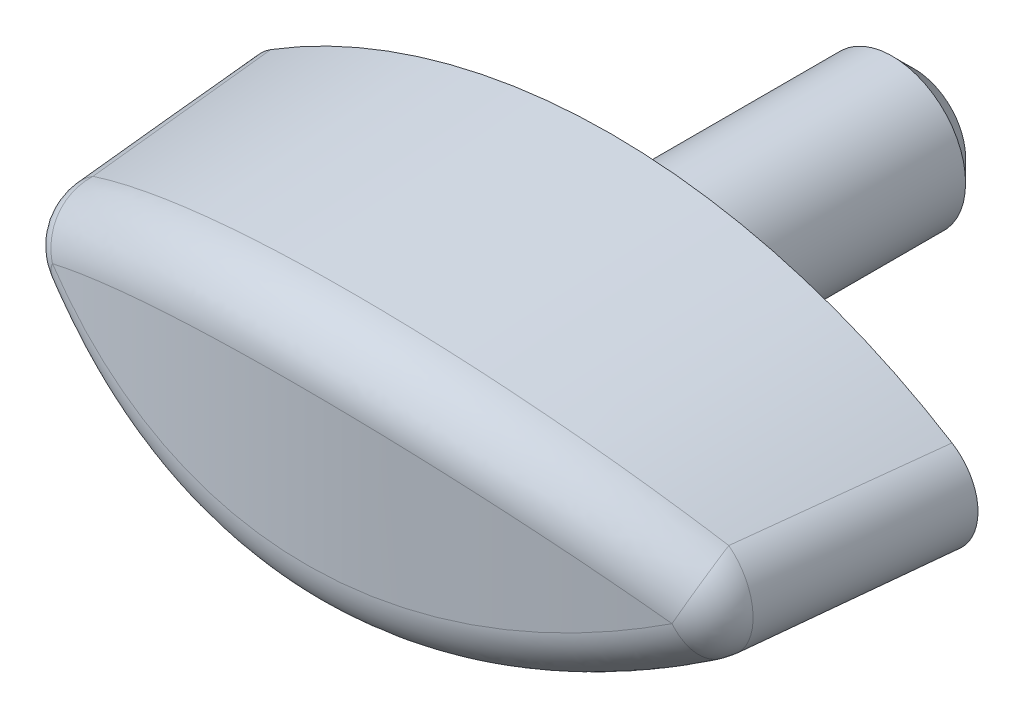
ISO-10303-21;
HEADER;
FILE_DESCRIPTION(('STEP AP214'),'2;1');
FILE_NAME('part.step','',(''),(''),'','','');
FILE_SCHEMA(('AUTOMOTIVE_DESIGN { 1 0 10303 214 1 1 1 1 }'));
ENDSEC;
DATA;
#1=APPLICATION_CONTEXT('core data for automotive mechanical design processes');
#2=APPLICATION_PROTOCOL_DEFINITION('international standard','automotive_design',2000,#1);
#3=PRODUCT_CONTEXT('',#1,'mechanical');
#4=PRODUCT('Part','Part','',(#3));
#5=PRODUCT_RELATED_PRODUCT_CATEGORY('part','',(#4));
#6=PRODUCT_DEFINITION_FORMATION('','',#4);
#7=PRODUCT_DEFINITION_CONTEXT('part definition',#1,'design');
#8=PRODUCT_DEFINITION('design','',#6,#7);
#9=PRODUCT_DEFINITION_SHAPE('','',#8);
#10=(LENGTH_UNIT() NAMED_UNIT(*) SI_UNIT(.MILLI.,.METRE.));
#11=(NAMED_UNIT(*) PLANE_ANGLE_UNIT() SI_UNIT($,.RADIAN.));
#12=(NAMED_UNIT(*) SI_UNIT($,.STERADIAN.) SOLID_ANGLE_UNIT());
#13=UNCERTAINTY_MEASURE_WITH_UNIT(LENGTH_MEASURE(1.E-05),#10,'distance_accuracy_value','');
#14=(GEOMETRIC_REPRESENTATION_CONTEXT(3) GLOBAL_UNCERTAINTY_ASSIGNED_CONTEXT((#13)) GLOBAL_UNIT_ASSIGNED_CONTEXT((#10,
#11,#12)) REPRESENTATION_CONTEXT('',''));
#15=CARTESIAN_POINT('',(0.,0.,0.));
#16=DIRECTION('',(0.,0.,1.));
#17=DIRECTION('',(1.,0.,0.));
#18=AXIS2_PLACEMENT_3D('',#15,#16,#17);
#19=CARTESIAN_POINT('',(-0.127919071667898,-27.3688144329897,0.4));
#20=DIRECTION('',(0.,0.,-1.));
#21=DIRECTION('',(1.,0.,0.));
#22=AXIS2_PLACEMENT_3D('',#19,#20,#21);
#23=CONICAL_SURFACE('',#22,35.2188144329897,0.05235987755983);
#24=CARTESIAN_POINT('',(-0.127919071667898,-27.3688144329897,0.4));
#25=DIRECTION('',(0.,0.,1.));
#26=DIRECTION('',(1.,0.,0.));
#27=AXIS2_PLACEMENT_3D('',#24,#25,#26);
#28=CIRCLE('',#27,35.2188144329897);
#29=CARTESIAN_POINT('',(18.461150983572,2.54458331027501,0.4));
#30=VERTEX_POINT('',#29);
#31=CARTESIAN_POINT('',(-18.7169891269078,2.54458331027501,0.4));
#32=VERTEX_POINT('',#31);
#33=EDGE_CURVE('E235',#30,#32,#28,.T.);
#34=ORIENTED_EDGE('',*,*,#33,.T.);
#35=CARTESIAN_POINT('',(-9.9420772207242,2.84937929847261,66.1700536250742));
#36=CARTESIAN_POINT('',(-11.9743980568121,2.17032947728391,66.5148628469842));
#37=CARTESIAN_POINT('',(-11.9743980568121,0.,66.5148628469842));
#38=CARTESIAN_POINT('',(-11.9743980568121,-2.1703294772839,66.5148628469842));
#39=CARTESIAN_POINT('',(-9.94207722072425,-2.84937929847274,66.1700536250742));
#40=CARTESIAN_POINT('',(-10.0578680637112,2.84614228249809,65.5462752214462));
#41=CARTESIAN_POINT('',(-12.0809823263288,2.16245952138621,65.8866121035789));
#42=CARTESIAN_POINT('',(-12.0811133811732,0.,65.8858334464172));
#43=CARTESIAN_POINT('',(-12.0809823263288,-2.16245952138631,65.8866121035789));
#44=CARTESIAN_POINT('',(-10.0578680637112,-2.84614228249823,65.5462752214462));
#45=CARTESIAN_POINT('',(-10.1718056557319,2.84291485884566,64.9222194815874));
#46=CARTESIAN_POINT('',(-12.1859994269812,2.15475428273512,65.2575420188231));
#47=CARTESIAN_POINT('',(-12.1861222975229,0.,65.2567934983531));
#48=CARTESIAN_POINT('',(-12.1859994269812,-2.15475428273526,65.2575420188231));
#49=CARTESIAN_POINT('',(-10.1718056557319,-2.84291485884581,64.9222194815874));
#50=CARTESIAN_POINT('',(-10.3962916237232,2.83647934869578,63.6736155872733));
#51=CARTESIAN_POINT('',(-12.3929059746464,2.13966577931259,63.9994335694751));
#52=CARTESIAN_POINT('',(-12.3930293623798,0.,63.9986847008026));
#53=CARTESIAN_POINT('',(-12.3929059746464,-2.13966577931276,63.9994335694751));
#54=CARTESIAN_POINT('',(-10.3962916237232,-2.83647934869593,63.6736155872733));
#55=CARTESIAN_POINT('',(-10.5068400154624,2.83327126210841,63.0490674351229));
#56=CARTESIAN_POINT('',(-12.4948132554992,2.1322809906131,63.3703319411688));
#57=CARTESIAN_POINT('',(-12.4949275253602,0.,63.3696158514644));
#58=CARTESIAN_POINT('',(-12.4948132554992,-2.13228099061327,63.3703319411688));
#59=CARTESIAN_POINT('',(-10.5068400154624,-2.83327126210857,63.0490674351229));
#60=CARTESIAN_POINT('',(-10.8338738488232,2.82367633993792,61.1747980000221));
#61=CARTESIAN_POINT('',(-12.7959488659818,2.11059028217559,61.4852332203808));
#62=CARTESIAN_POINT('',(-12.7964057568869,0.,61.4823746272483));
#63=CARTESIAN_POINT('',(-12.7959488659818,-2.11059028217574,61.4852332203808));
#64=CARTESIAN_POINT('',(-10.8338738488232,-2.82367633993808,61.1747980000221));
#65=CARTESIAN_POINT('',(-11.0457532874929,2.81731869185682,59.9244228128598));
#66=CARTESIAN_POINT('',(-12.9913741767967,2.09669040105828,60.2267788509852));
#67=CARTESIAN_POINT('',(-12.9917744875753,0.,60.2241384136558));
#68=CARTESIAN_POINT('',(-12.9913741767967,-2.09669040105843,60.2267788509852));
#69=CARTESIAN_POINT('',(-11.0457532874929,-2.81731869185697,59.9244228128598));
#70=CARTESIAN_POINT('',(-11.4591627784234,2.8046821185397,57.4223869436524));
#71=CARTESIAN_POINT('',(-13.3727069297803,2.06988168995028,57.7101943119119));
#72=CARTESIAN_POINT('',(-13.3731048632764,0.,57.7075667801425));
#73=CARTESIAN_POINT('',(-13.3727069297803,-2.06988168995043,57.7101943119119));
#74=CARTESIAN_POINT('',(-11.4591627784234,-2.80468211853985,57.4223869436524));
#75=CARTESIAN_POINT('',(-11.6606936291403,2.79840318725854,56.1707263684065));
#76=CARTESIAN_POINT('',(-13.5587131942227,2.05696454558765,56.4516773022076));
#77=CARTESIAN_POINT('',(-13.5590672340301,0.,56.4492313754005));
#78=CARTESIAN_POINT('',(-13.5587131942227,-2.0569645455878,56.4516773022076));
#79=CARTESIAN_POINT('',(-11.6606936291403,-2.79840318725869,56.1707263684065));
#80=CARTESIAN_POINT('',(-12.0548928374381,2.78592331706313,53.6662651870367));
#81=CARTESIAN_POINT('',(-13.9226228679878,2.03197951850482,53.9347762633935));
#82=CARTESIAN_POINT('',(-13.9229740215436,0.,53.9323448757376));
#83=CARTESIAN_POINT('',(-13.9226228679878,-2.03197951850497,53.9347762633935));
#84=CARTESIAN_POINT('',(-12.0548928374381,-2.78592331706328,53.6662651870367));
#85=CARTESIAN_POINT('',(-12.2475611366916,2.77972237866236,52.4134645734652));
#86=CARTESIAN_POINT('',(-14.1006055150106,2.01990506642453,52.6760596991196));
#87=CARTESIAN_POINT('',(-14.1009183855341,0.,52.6737937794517));
#88=CARTESIAN_POINT('',(-14.1006055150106,-2.01990506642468,52.6760596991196));
#89=CARTESIAN_POINT('',(-12.2475611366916,-2.77972237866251,52.4134645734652));
#90=CARTESIAN_POINT('',(-12.8140079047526,2.76123825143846,48.6541414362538));
#91=CARTESIAN_POINT('',(-14.6230780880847,1.98485174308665,48.9073744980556));
#92=CARTESIAN_POINT('',(-14.6243370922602,0.,48.8983113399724));
#93=CARTESIAN_POINT('',(-14.6230780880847,-1.9848517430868,48.9073744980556));
#94=CARTESIAN_POINT('',(-12.8140079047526,-2.76123825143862,48.6541414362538));
#95=CARTESIAN_POINT('',(-13.1763076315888,2.749071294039,46.1462109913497));
#96=CARTESIAN_POINT('',(-14.958435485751,1.96287987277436,46.3890716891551));
#97=CARTESIAN_POINT('',(-14.9594702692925,0.,46.3810615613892));
#98=CARTESIAN_POINT('',(-14.958435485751,-1.96287987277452,46.3890716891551));
#99=CARTESIAN_POINT('',(-13.1763076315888,-2.74907129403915,46.1462109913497));
#100=CARTESIAN_POINT('',(-13.8771281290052,2.72504071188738,41.1276098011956));
#101=CARTESIAN_POINT('',(-15.6074326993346,1.92123528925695,41.353678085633));
#102=CARTESIAN_POINT('',(-15.6084527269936,0.,41.3457454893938));
#103=CARTESIAN_POINT('',(-15.6074326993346,-1.9212352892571,41.353678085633));
#104=CARTESIAN_POINT('',(-13.8771281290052,-2.72504071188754,41.1276098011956));
#105=CARTESIAN_POINT('',(-14.2156483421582,2.71317709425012,38.6169389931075));
#106=CARTESIAN_POINT('',(-15.9214384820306,1.9015334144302,38.8347968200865));
#107=CARTESIAN_POINT('',(-15.9223015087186,0.,38.8276791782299));
#108=CARTESIAN_POINT('',(-15.9214384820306,-1.90153341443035,38.8347968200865));
#109=CARTESIAN_POINT('',(-14.2156483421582,-2.71317709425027,38.6169389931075));
#110=CARTESIAN_POINT('',(-14.8733814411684,2.68974887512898,33.5943492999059));
#111=CARTESIAN_POINT('',(-16.5319385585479,1.86398835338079,33.7987360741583));
#112=CARTESIAN_POINT('',(-16.5327955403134,0.,33.7916652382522));
#113=CARTESIAN_POINT('',(-16.5319385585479,-1.86398835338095,33.7987360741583));
#114=CARTESIAN_POINT('',(-14.8733814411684,-2.68974887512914,33.5943492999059));
#115=CARTESIAN_POINT('',(-15.192600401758,2.67818418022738,31.0824310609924));
#116=CARTESIAN_POINT('',(-16.8287096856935,1.84612351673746,31.2801176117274));
#117=CARTESIAN_POINT('',(-16.8294462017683,0.,31.2737178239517));
#118=CARTESIAN_POINT('',(-16.8287096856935,-1.84612351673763,31.2801176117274));
#119=CARTESIAN_POINT('',(-15.192600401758,-2.67818418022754,31.0824310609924));
#120=CARTESIAN_POINT('',(-15.8151826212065,2.6553411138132,26.0570201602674));
#121=CARTESIAN_POINT('',(-17.4079475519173,1.81192131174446,26.2436110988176));
#122=CARTESIAN_POINT('',(-17.4086785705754,0.,26.2372505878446));
#123=CARTESIAN_POINT('',(-17.4079475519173,-1.81192131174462,26.2436110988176));
#124=CARTESIAN_POINT('',(-15.8151826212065,-2.65534111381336,26.0570201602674));
#125=CARTESIAN_POINT('',(-16.1185460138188,2.64406273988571,23.5435275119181));
#126=CARTESIAN_POINT('',(-17.6906230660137,1.79556816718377,23.7245322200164));
#127=CARTESIAN_POINT('',(-17.6912603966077,0.,23.7187307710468));
#128=CARTESIAN_POINT('',(-17.6906230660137,-1.79556816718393,23.7245322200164));
#129=CARTESIAN_POINT('',(-16.1185460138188,-2.64406273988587,23.5435275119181));
#130=CARTESIAN_POINT('',(-16.7119326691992,2.62178242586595,18.5151154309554));
#131=CARTESIAN_POINT('',(-18.2439924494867,1.76414591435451,18.6868014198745));
#132=CARTESIAN_POINT('',(-18.2446268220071,0.,18.6810256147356));
#133=CARTESIAN_POINT('',(-18.2439924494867,-1.76414591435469,18.6868014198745));
#134=CARTESIAN_POINT('',(-16.7119326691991,-2.62178242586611,18.5151154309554));
#135=CARTESIAN_POINT('',(-17.001955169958,2.61078050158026,16.0001959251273));
#136=CARTESIAN_POINT('',(-18.5148503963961,1.74906476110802,16.1671467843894));
#137=CARTESIAN_POINT('',(-18.5154107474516,0.,16.161840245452));
#138=CARTESIAN_POINT('',(-18.5148503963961,-1.74906476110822,16.1671467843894));
#139=CARTESIAN_POINT('',(-17.001955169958,-2.61078050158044,16.0001959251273));
#140=CARTESIAN_POINT('',(-17.5705528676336,2.58904463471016,10.969297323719));
#141=CARTESIAN_POINT('',(-19.0463273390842,1.72000174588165,11.1282747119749));
#142=CARTESIAN_POINT('',(-19.0468825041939,0.,11.1230051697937));
#143=CARTESIAN_POINT('',(-19.0463273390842,-1.72000174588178,11.1282747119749));
#144=CARTESIAN_POINT('',(-17.5705528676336,-2.58904463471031,10.969297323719));
#145=CARTESIAN_POINT('',(-17.8491280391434,2.57831069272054,8.45331822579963));
#146=CARTESIAN_POINT('',(-19.3070793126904,1.70601035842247,8.60820031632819));
#147=CARTESIAN_POINT('',(-19.3075703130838,0.,8.60335546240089));
#148=CARTESIAN_POINT('',(-19.3070793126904,-1.7060103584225,8.60820031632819));
#149=CARTESIAN_POINT('',(-17.8491280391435,-2.57831069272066,8.45331822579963));
#150=CARTESIAN_POINT('',(-18.6698519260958,2.54650453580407,0.905774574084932));
#151=CARTESIAN_POINT('',(-20.0744490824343,1.66554621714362,1.06490118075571));
#152=CARTESIAN_POINT('',(-20.0764257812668,0.,1.0455066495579));
#153=CARTESIAN_POINT('',(-20.0744490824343,-1.66554621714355,1.06490118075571));
#154=CARTESIAN_POINT('',(-18.6698519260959,-2.54650453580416,0.905774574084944));
#155=CARTESIAN_POINT('',(-19.1971985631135,2.52582042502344,-4.12710669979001));
#156=CARTESIAN_POINT('',(-20.5699700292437,1.64037213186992,-3.97658913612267));
#157=CARTESIAN_POINT('',(-20.5715716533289,0.,-3.99330548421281));
#158=CARTESIAN_POINT('',(-20.5699700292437,-1.64037213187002,-3.97658913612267));
#159=CARTESIAN_POINT('',(-19.1971985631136,-2.52582042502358,-4.12710669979));
#160=CARTESIAN_POINT('',(-20.2213310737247,2.4854191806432,-14.1952793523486));
#161=CARTESIAN_POINT('',(-21.5335070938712,1.59297490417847,-14.0555607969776));
#162=CARTESIAN_POINT('',(-21.5350839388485,-1.15183904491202E-13,-14.0720924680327));
#163=CARTESIAN_POINT('',(-21.5335070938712,-1.5929749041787,-14.0555607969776));
#164=CARTESIAN_POINT('',(-20.2213310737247,-2.48541918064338,-14.1952793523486));
#165=CARTESIAN_POINT('',(-20.7181176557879,2.46570202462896,-19.230570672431));
#166=CARTESIAN_POINT('',(-22.0021355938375,1.57071112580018,-19.0975815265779));
#167=CARTESIAN_POINT('',(-22.0034509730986,0.,-19.1120672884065));
#168=CARTESIAN_POINT('',(-22.0021355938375,-1.57071112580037,-19.0975815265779));
#169=CARTESIAN_POINT('',(-20.7181176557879,-2.46570202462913,-19.230570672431));
#170=CARTESIAN_POINT('',(-21.6873105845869,2.42716450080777,-29.3045674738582));
#171=CARTESIAN_POINT('',(-22.9175853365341,1.52853719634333,-29.1801362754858));
#172=CARTESIAN_POINT('',(-22.9188936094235,0.,-29.1945468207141));
#173=CARTESIAN_POINT('',(-22.9175853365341,-1.52853719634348,-29.1801362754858));
#174=CARTESIAN_POINT('',(-21.6873105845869,-2.42716450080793,-29.3045674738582));
#175=CARTESIAN_POINT('',(-22.1597097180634,2.40834439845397,-34.3432735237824));
#176=CARTESIAN_POINT('',(-23.3648531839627,1.50859917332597,-34.2242978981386));
#177=CARTESIAN_POINT('',(-23.365962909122,0.,-34.2370518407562));
#178=CARTESIAN_POINT('',(-23.3648531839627,-1.50859917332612,-34.2242978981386));
#179=CARTESIAN_POINT('',(-22.1597097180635,-2.40834439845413,-34.3432735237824));
#180=CARTESIAN_POINT('',(-22.853197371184,2.38074702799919,-41.902509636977));
#181=CARTESIAN_POINT('',(-24.0231200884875,1.4801068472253,-41.7983357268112));
#182=CARTESIAN_POINT('',(-24.0233942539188,0.,-41.801497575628));
#183=CARTESIAN_POINT('',(-24.0231200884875,-1.48010684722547,-41.7983357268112));
#184=CARTESIAN_POINT('',(-22.8531973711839,-2.38074702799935,-41.902509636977));
#185=CARTESIAN_POINT('',(-23.0818432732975,2.37165329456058,-44.42247237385));
#186=CARTESIAN_POINT('',(-24.2400890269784,1.47085913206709,-44.3201209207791));
#187=CARTESIAN_POINT('',(-24.2403443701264,0.,-44.3231153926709));
#188=CARTESIAN_POINT('',(-24.2400890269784,-1.47085913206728,-44.3201209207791));
#189=CARTESIAN_POINT('',(-23.0818432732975,-2.37165329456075,-44.42247237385));
#190=CARTESIAN_POINT('',(-23.5345146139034,2.35366995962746,-49.462737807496));
#191=CARTESIAN_POINT('',(-24.6699660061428,1.45280372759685,-49.3635662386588));
#192=CARTESIAN_POINT('',(-24.6702200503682,0.,-49.3665480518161));
#193=CARTESIAN_POINT('',(-24.6699660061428,-1.452803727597,-49.3635662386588));
#194=CARTESIAN_POINT('',(-23.5345146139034,-2.35366995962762,-49.462737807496));
#195=CARTESIAN_POINT('',(-23.7585400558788,2.34478035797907,-51.9830405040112));
#196=CARTESIAN_POINT('',(-24.8829123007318,1.4439937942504,-51.8855627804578));
#197=CARTESIAN_POINT('',(-24.8831456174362,0.,-51.8883628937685));
#198=CARTESIAN_POINT('',(-24.8829123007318,-1.4439937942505,-51.8855627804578));
#199=CARTESIAN_POINT('',(-23.7585400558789,-2.34478035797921,-51.9830405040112));
#200=CARTESIAN_POINT('',(-23.9804644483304,2.33598938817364,-54.5034959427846));
#201=CARTESIAN_POINT('',(-25.0942429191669,1.43537470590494,-54.4102690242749));
#202=CARTESIAN_POINT('',(-25.0942429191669,0.,-54.4102690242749));
#203=CARTESIAN_POINT('',(-25.0942429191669,-1.43537470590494,-54.4102690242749));
#204=CARTESIAN_POINT('',(-23.9804644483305,-2.33598938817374,-54.5034959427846));
#205=(BOUNDED_SURFACE() B_SPLINE_SURFACE(3,2,((#35,#36,#37,#38,#39),(#40,#41,#42,#43,#44),(#45,
#46,#47,#48,#49),(#50,#51,#52,#53,#54),(#55,#56,#57,#58,#59),(#60,#61,#62,#63,#64),(#65,#66,#67,
#68,#69),(#70,#71,#72,#73,#74),(#75,#76,#77,#78,#79),(#80,#81,#82,#83,#84),(#85,#86,#87,#88,
#89),(#90,#91,#92,#93,#94),(#95,#96,#97,#98,#99),(#100,#101,#102,#103,#104),(#105,#106,#107,
#108,#109),(#110,#111,#112,#113,#114),(#115,#116,#117,#118,#119),(#120,#121,#122,#123,#124),
(#125,#126,#127,#128,#129),(#130,#131,#132,#133,#134),(#135,#136,#137,#138,#139),(#140,#141,
#142,#143,#144),(#145,#146,#147,#148,#149),(#150,#151,#152,#153,#154),(#155,#156,#157,#158,
#159),(#160,#161,#162,#163,#164),(#165,#166,#167,#168,#169),(#170,#171,#172,#173,#174),(#175,
#176,#177,#178,#179),(#180,#181,#182,#183,#184),(#185,#186,#187,#188,#189),(#190,#191,#192,#193,
#194),(#195,#196,#197,#198,#199),(#200,#201,#202,#203,#204)),.UNSPECIFIED.,.F.,.F.,
.F.) B_SPLINE_SURFACE_WITH_KNOTS((4,2,2,2,2,2,2,2,2,2,2,2,2,2,2,2,4),(3,2,3),(0.,
1.89806852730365,3.79612822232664,7.59215961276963,11.3878976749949,15.1836607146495,
22.7737107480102,30.3639386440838,37.9517650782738,45.5395274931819,53.1277227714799,
60.715934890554,75.8871979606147,91.0581091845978,106.233482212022,113.821296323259,
121.409104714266),(0.,0.5,1.),
.UNSPECIFIED.) GEOMETRIC_REPRESENTATION_ITEM() RATIONAL_B_SPLINE_SURFACE(((1.,0.810209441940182,
1.,0.810209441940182,1.),(1.,0.811220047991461,1.,0.811220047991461,1.),(1.,0.812208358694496,
1.,0.812208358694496,1.),(1.,0.814144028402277,1.,0.814144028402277,1.),(1.,0.815091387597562,
1.,0.815091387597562,1.),(1.,0.817877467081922,1.,0.817877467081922,1.),(1.,0.819660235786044,
1.,0.819660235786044,1.),(1.,0.823099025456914,1.,0.823099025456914,1.),(1.,0.824755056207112,
1.,0.824755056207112,1.),(1.,0.827957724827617,1.,0.827957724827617,1.),(1.,0.829504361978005,
1.,0.829504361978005,1.),(1.,0.834000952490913,1.,0.834000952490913,1.),(1.,0.836808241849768,
1.,0.836808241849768,1.),(1.,0.842123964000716,1.,0.842123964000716,1.),(1.,0.844632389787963,
1.,0.844632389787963,1.),(1.,0.849405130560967,1.,0.849405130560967,1.),(1.,0.85166952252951,1.,
0.85166952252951,1.),(1.,0.855995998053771,1.,0.855995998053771,1.),(1.,0.858058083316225,1.,
0.858058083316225,1.),(1.,0.86201098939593,1.,0.86201098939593,1.),(1.,0.86390180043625,1.,
0.86390180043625,1.),(1.,0.867535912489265,1.,0.867535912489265,1.),(1.,0.869279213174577,1.,
0.869279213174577,1.),(1.,0.874316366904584,1.,0.874316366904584,1.),(1.,0.877418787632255,1.,
0.877418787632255,1.),(1.,0.8832267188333,1.,0.8832267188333,1.),(1.,0.885932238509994,1.,
0.885932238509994,1.),(1.,0.89102494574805,1.,0.89102494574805,1.),(1.,0.893412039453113,1.,
0.893412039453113,1.),(1.,0.896796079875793,1.,0.896796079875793,1.),(1.,0.897891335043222,1.,
0.897891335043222,1.),(1.,0.900021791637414,1.,0.900021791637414,1.),(1.,0.901056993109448,1.,
0.901056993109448,1.),(1.,0.902064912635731,1.,0.902064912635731,1.))) REPRESENTATION_ITEM('') SURFACE());
#206=CARTESIAN_POINT('',(-23.9804644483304,2.33598938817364,-54.5034959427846));
#207=CARTESIAN_POINT('',(-23.7585400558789,2.34478035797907,-51.9830405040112));
#208=CARTESIAN_POINT('',(-23.5345146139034,2.35366995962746,-49.462737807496));
#209=CARTESIAN_POINT('',(-23.0818432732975,2.37165329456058,-44.42247237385));
#210=CARTESIAN_POINT('',(-22.853197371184,2.38074702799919,-41.902509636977));
#211=CARTESIAN_POINT('',(-22.1597097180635,2.40834439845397,-34.3432735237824));
#212=CARTESIAN_POINT('',(-21.6873105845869,2.42716450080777,-29.3045674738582));
#213=CARTESIAN_POINT('',(-20.7181176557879,2.46570202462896,-19.230570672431));
#214=CARTESIAN_POINT('',(-20.2213310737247,2.4854191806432,-14.1952793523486));
#215=CARTESIAN_POINT('',(-19.1971985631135,2.52582042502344,-4.12710669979));
#216=CARTESIAN_POINT('',(-18.6698519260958,2.54650453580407,0.905774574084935));
#217=CARTESIAN_POINT('',(-17.8491280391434,2.57831069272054,8.45331822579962));
#218=CARTESIAN_POINT('',(-17.5705528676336,2.58904463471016,10.969297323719));
#219=CARTESIAN_POINT('',(-17.001955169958,2.61078050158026,16.0001959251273));
#220=CARTESIAN_POINT('',(-16.7119326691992,2.62178242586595,18.5151154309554));
#221=CARTESIAN_POINT('',(-16.1185460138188,2.64406273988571,23.5435275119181));
#222=CARTESIAN_POINT('',(-15.8151826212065,2.6553411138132,26.0570201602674));
#223=CARTESIAN_POINT('',(-15.192600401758,2.67818418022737,31.0824310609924));
#224=CARTESIAN_POINT('',(-14.8733814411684,2.68974887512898,33.5943492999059));
#225=CARTESIAN_POINT('',(-14.2156483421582,2.71317709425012,38.6169389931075));
#226=CARTESIAN_POINT('',(-13.8771281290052,2.72504071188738,41.1276098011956));
#227=CARTESIAN_POINT('',(-13.1763076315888,2.749071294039,46.1462109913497));
#228=CARTESIAN_POINT('',(-12.8140079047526,2.76123825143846,48.6541414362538));
#229=CARTESIAN_POINT('',(-12.2475611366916,2.77972237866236,52.4134645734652));
#230=CARTESIAN_POINT('',(-12.0548928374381,2.78592331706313,53.6662651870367));
#231=CARTESIAN_POINT('',(-11.6606936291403,2.79840318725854,56.1707263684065));
#232=CARTESIAN_POINT('',(-11.4591627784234,2.8046821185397,57.4223869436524));
#233=CARTESIAN_POINT('',(-11.0457532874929,2.81731869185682,59.9244228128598));
#234=CARTESIAN_POINT('',(-10.8338738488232,2.82367633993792,61.1747980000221));
#235=CARTESIAN_POINT('',(-10.5068400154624,2.83327126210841,63.0490674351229));
#236=CARTESIAN_POINT('',(-10.3962916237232,2.83647934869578,63.6736155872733));
#237=CARTESIAN_POINT('',(-10.1718056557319,2.84291485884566,64.9222194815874));
#238=CARTESIAN_POINT('',(-10.0578680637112,2.84614228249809,65.5462752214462));
#239=CARTESIAN_POINT('',(-9.9420772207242,2.84937929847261,66.1700536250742));
#240=B_SPLINE_CURVE_WITH_KNOTS('',3,(#206,#207,#208,#209,#210,#211,#212,#213,#214,#215,#216,
#217,#218,#219,#220,#221,#222,#223,#224,#225,#226,#227,#228,#229,#230,#231,#232,#233,#234,#235,
#236,#237,#238,#239),.UNSPECIFIED.,.F.,.F.,(4,2,2,2,2,2,2,2,2,2,2,2,2,2,2,2,4),(0.,
7.58780839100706,15.1756225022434,30.3509955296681,45.5219067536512,60.6931698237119,
68.281381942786,75.869577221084,83.4573396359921,91.0451660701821,98.6353939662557,
106.225443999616,110.021207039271,113.816945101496,117.612976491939,119.511036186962,
121.409104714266),.UNSPECIFIED.);
#241=CARTESIAN_POINT('',(-17.5334884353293,2.5904405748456,11.2843807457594));
#242=VERTEX_POINT('',#241);
#243=EDGE_CURVE('E185',#32,#242,#240,.T.);
#244=ORIENTED_EDGE('',*,*,#243,.T.);
#245=CARTESIAN_POINT('',(-25.9060429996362,-6.5678676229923,9.45201347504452));
#246=CARTESIAN_POINT('',(-26.9568343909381,-5.22396085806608,8.77235175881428));
#247=CARTESIAN_POINT('',(-26.5466378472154,-4.61264985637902,7.09002431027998));
#248=CARTESIAN_POINT('',(-25.5763535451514,-6.22525334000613,9.66526230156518));
#249=CARTESIAN_POINT('',(-26.6316801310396,-4.84810499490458,8.99498365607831));
#250=CARTESIAN_POINT('',(-26.2093888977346,-4.23718862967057,7.28986126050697));
#251=CARTESIAN_POINT('',(-25.2386424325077,-5.88917214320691,9.8779192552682));
#252=CARTESIAN_POINT('',(-26.2990198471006,-4.47979637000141,9.21680138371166));
#253=CARTESIAN_POINT('',(-25.8638860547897,-3.86884377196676,7.48914356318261));
#254=CARTESIAN_POINT('',(-24.5472957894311,-5.23032017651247,10.3008712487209));
#255=CARTESIAN_POINT('',(-25.6165844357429,-3.75580524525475,9.65919199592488));
#256=CARTESIAN_POINT('',(-25.1564872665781,-3.14666241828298,7.88549480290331));
#257=CARTESIAN_POINT('',(-24.1936595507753,-4.90754999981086,10.5111661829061));
#258=CARTESIAN_POINT('',(-25.2666418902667,-3.40016897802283,9.87978368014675));
#259=CARTESIAN_POINT('',(-24.79459059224,-2.79282656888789,8.08256364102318));
#260=CARTESIAN_POINT('',(-23.1084052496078,-3.95902178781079,11.13710505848));
#261=CARTESIAN_POINT('',(-24.1863043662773,-2.34815148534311,10.5407319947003));
#262=CARTESIAN_POINT('',(-23.6838306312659,-1.75289230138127,8.6691352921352));
#263=CARTESIAN_POINT('',(-22.3530634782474,-3.35369283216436,11.5473966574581));
#264=CARTESIAN_POINT('',(-23.4330116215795,-1.67552627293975,10.9749701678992));
#265=CARTESIAN_POINT('',(-22.9105335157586,-1.08907596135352,9.05362238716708));
#266=CARTESIAN_POINT('',(-20.7762917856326,-2.19765537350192,12.346700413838));
#267=CARTESIAN_POINT('',(-21.8523984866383,-0.38215286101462,11.82673286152));
#268=CARTESIAN_POINT('',(-21.2958474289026,0.178913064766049,9.80265546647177));
#269=CARTESIAN_POINT('',(-19.9544570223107,-1.64733547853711,12.7355535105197));
#270=CARTESIAN_POINT('',(-21.023675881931,0.237229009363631,12.2437476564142));
#271=CARTESIAN_POINT('',(-20.4540411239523,0.782661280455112,10.1670523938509));
#272=CARTESIAN_POINT('',(-18.2519937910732,-0.610848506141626,13.4796245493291));
#273=CARTESIAN_POINT('',(-19.296546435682,1.41287325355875,13.0479460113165));
#274=CARTESIAN_POINT('',(-18.7097774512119,1.91998638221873,10.8643265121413));
#275=CARTESIAN_POINT('',(-17.3713964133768,-0.124647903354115,13.834860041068));
#276=CARTESIAN_POINT('',(-18.3975762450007,1.96785628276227,13.4344551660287));
#277=CARTESIAN_POINT('',(-17.8073521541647,2.45359993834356,11.1972201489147));
#278=CARTESIAN_POINT('',(-15.7295627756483,0.691442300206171,14.4386374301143));
#279=CARTESIAN_POINT('',(-16.7123853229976,2.90601325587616,14.0960791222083));
#280=CARTESIAN_POINT('',(-16.1244568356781,3.34941894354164,11.7630241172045));
#281=CARTESIAN_POINT('',(-14.9778623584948,1.03342158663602,14.6945703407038));
#282=CARTESIAN_POINT('',(-15.9357559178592,3.30180147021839,14.3784810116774));
#283=CARTESIAN_POINT('',(-15.3538290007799,3.72486502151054,12.002860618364));
#284=CARTESIAN_POINT('',(-13.4414401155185,1.6686462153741,15.1740241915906));
#285=CARTESIAN_POINT('',(-14.3391574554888,4.04212002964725,14.9112368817));
#286=CARTESIAN_POINT('',(-13.7784800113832,4.42233580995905,12.4521601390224));
#287=CARTESIAN_POINT('',(-12.6567245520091,1.96190074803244,15.3975512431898));
#288=CARTESIAN_POINT('',(-13.5196106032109,4.38565861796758,15.1609311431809));
#289=CARTESIAN_POINT('',(-12.9737653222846,4.74437059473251,12.6616288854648));
#290=CARTESIAN_POINT('',(-11.0608084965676,2.49543766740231,15.8071244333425));
#291=CARTESIAN_POINT('',(-11.8431888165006,5.0150093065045,15.6216067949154));
#292=CARTESIAN_POINT('',(-11.3369644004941,5.33032755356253,13.0454427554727));
#293=CARTESIAN_POINT('',(-10.2497109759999,2.73590291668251,15.993299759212));
#294=CARTESIAN_POINT('',(-10.9872863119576,5.29998469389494,15.8319990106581));
#295=CARTESIAN_POINT('',(-10.5049845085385,5.59445033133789,13.2199089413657));
#296=CARTESIAN_POINT('',(-8.60324098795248,3.16197518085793,16.3252089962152));
#297=CARTESIAN_POINT('',(-9.24035173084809,5.80822566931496,16.2094862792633));
#298=CARTESIAN_POINT('',(-8.81594977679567,6.06247820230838,13.5309433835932));
#299=CARTESIAN_POINT('',(-7.76787400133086,3.34759447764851,16.4709519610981));
#300=CARTESIAN_POINT('',(-8.35066990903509,6.03049926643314,16.375865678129));
#301=CARTESIAN_POINT('',(-7.95890059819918,6.26639677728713,13.6675201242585));
#302=CARTESIAN_POINT('',(-6.29899792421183,3.62036059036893,16.6864405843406));
#303=CARTESIAN_POINT('',(-6.78013114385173,6.35873278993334,16.6229913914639));
#304=CARTESIAN_POINT('',(-6.45178406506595,6.56607248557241,13.8694560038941));
#305=CARTESIAN_POINT('',(-5.66965505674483,3.72056377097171,16.7660933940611));
#306=CARTESIAN_POINT('',(-6.10518928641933,6.47970396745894,16.7146060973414));
#307=CARTESIAN_POINT('',(-5.8060211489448,6.67616820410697,13.9440992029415));
#308=CARTESIAN_POINT('',(-4.40330060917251,3.88868776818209,16.9005531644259));
#309=CARTESIAN_POINT('',(-4.74332376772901,6.68337557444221,16.8697106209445));
#310=CARTESIAN_POINT('',(-4.50657318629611,6.86089822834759,14.0701023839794));
#311=CARTESIAN_POINT('',(-3.76628785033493,3.95660355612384,16.9553562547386));
#312=CARTESIAN_POINT('',(-4.05725327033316,6.76579746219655,16.9329921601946));
#313=CARTESIAN_POINT('',(-3.85288692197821,6.93552701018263,14.1214587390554));
#314=CARTESIAN_POINT('',(-2.48706633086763,4.0595240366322,17.0393945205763));
#315=CARTESIAN_POINT('',(-2.67669949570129,6.89108237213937,17.0301954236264));
#316=CARTESIAN_POINT('',(-2.54014900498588,7.04862641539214,14.2002115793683));
#317=CARTESIAN_POINT('',(-1.84485399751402,4.09450374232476,17.0686102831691));
#318=CARTESIAN_POINT('',(-1.98315952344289,6.93373781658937,17.063960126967));
#319=CARTESIAN_POINT('',(-1.88109366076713,7.08706958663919,14.2275898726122));
#320=CARTESIAN_POINT('',(-0.55884477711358,4.13112920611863,17.1010243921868));
#321=CARTESIAN_POINT('',(-0.592662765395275,6.97862079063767,17.1013373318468));
#322=CARTESIAN_POINT('',(-0.561344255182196,7.12733004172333,14.2579653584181));
#323=CARTESIAN_POINT('',(0.0849517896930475,4.13278122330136,17.1042276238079));
#324=CARTESIAN_POINT('',(0.103295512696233,6.98078942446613,17.1049030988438));
#325=CARTESIAN_POINT('',(0.0993494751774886,7.12915420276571,14.2609671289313));
#326=CARTESIAN_POINT('',(1.58257907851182,4.09777629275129,17.0813510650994));
#327=CARTESIAN_POINT('',(1.72269372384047,6.93858223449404,17.0779434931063));
#328=CARTESIAN_POINT('',(1.63627384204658,7.09071283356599,14.2395293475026));
#329=CARTESIAN_POINT('',(2.43597086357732,4.048363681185,17.0453117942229));
#330=CARTESIAN_POINT('',(2.64395109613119,6.87879894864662,17.035916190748));
#331=CARTESIAN_POINT('',(2.51205079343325,7.03643179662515,14.2057566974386));
#332=CARTESIAN_POINT('',(4.13359500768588,3.89140741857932,16.9281394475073));
#333=CARTESIAN_POINT('',(4.4752281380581,6.68874417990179,16.8996130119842));
#334=CARTESIAN_POINT('',(4.25414186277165,6.86400449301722,14.0959536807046));
#335=CARTESIAN_POINT('',(4.97782548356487,3.78385203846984,16.846997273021));
#336=CARTESIAN_POINT('',(5.38304903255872,6.5589210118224,16.8056638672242));
#337=CARTESIAN_POINT('',(5.12045403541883,6.74584534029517,14.0199147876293));
#338=CARTESIAN_POINT('',(6.65083740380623,3.51223605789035,16.6415410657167));
#339=CARTESIAN_POINT('',(7.17821221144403,6.23160893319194,16.5683895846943));
#340=CARTESIAN_POINT('',(6.83711702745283,6.44746416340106,13.8273803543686));
#341=CARTESIAN_POINT('',(7.47961276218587,3.34815367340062,16.5172103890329));
#342=CARTESIAN_POINT('',(8.06366876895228,6.03483393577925,16.4255836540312));
#343=CARTESIAN_POINT('',(7.68746155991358,6.26721821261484,13.7108692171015));
#344=CARTESIAN_POINT('',(9.11553745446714,2.96588856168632,16.228232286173));
#345=CARTESIAN_POINT('',(9.80566995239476,5.57782829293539,16.0948656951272));
#346=CARTESIAN_POINT('',(9.3658133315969,5.8473288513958,13.440065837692));
#347=CARTESIAN_POINT('',(9.92268757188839,2.74770779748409,16.0635863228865));
#348=CARTESIAN_POINT('',(10.6607576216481,5.31851951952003,15.9076146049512));
#349=CARTESIAN_POINT('',(10.1938213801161,5.60768759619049,13.2857749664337));
#350=CARTESIAN_POINT('',(11.5057117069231,2.26158364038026,15.698605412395));
#351=CARTESIAN_POINT('',(12.330813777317,4.74312513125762,15.4943867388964));
#352=CARTESIAN_POINT('',(11.8175712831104,5.07380137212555,12.9437488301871));
#353=CARTESIAN_POINT('',(12.2817450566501,1.99394845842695,15.498491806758));
#354=CARTESIAN_POINT('',(13.1449616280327,4.42838600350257,15.2693460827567));
#355=CARTESIAN_POINT('',(12.6134776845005,4.77989460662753,12.7562209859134));
#356=CARTESIAN_POINT('',(13.8037702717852,1.41110283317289,15.0658337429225));
#357=CARTESIAN_POINT('',(14.7342023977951,3.74621355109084,14.785275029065));
#358=CARTESIAN_POINT('',(14.1742726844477,4.13991192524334,12.3507741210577));
#359=CARTESIAN_POINT('',(14.5497618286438,1.09589190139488,14.8332889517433));
#360=CARTESIAN_POINT('',(15.5087395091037,3.37973795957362,14.5268890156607));
#361=CARTESIAN_POINT('',(14.9391609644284,3.79383547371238,12.1328547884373));
#362=CARTESIAN_POINT('',(16.0096832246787,0.420489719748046,14.3396389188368));
#363=CARTESIAN_POINT('',(17.016955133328,2.59848218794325,13.9813573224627));
#364=CARTESIAN_POINT('',(16.4358364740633,3.05239823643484,11.6702519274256));
#365=CARTESIAN_POINT('',(16.7235672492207,0.0602368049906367,14.0784945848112));
#366=CARTESIAN_POINT('',(17.750402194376,2.1845075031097,13.6947250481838));
#367=CARTESIAN_POINT('',(17.1675764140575,2.65696988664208,11.4255317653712));
#368=CARTESIAN_POINT('',(18.1159521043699,-0.702021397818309,13.5322812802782));
#369=CARTESIAN_POINT('',(19.1737412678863,1.31310015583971,13.0985006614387));
#370=CARTESIAN_POINT('',(18.5945470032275,1.8204093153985,10.9136714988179));
#371=CARTESIAN_POINT('',(18.7944484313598,-1.10403198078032,13.2472092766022));
#372=CARTESIAN_POINT('',(19.86374473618,0.856413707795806,12.7893404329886));
#373=CARTESIAN_POINT('',(19.2897730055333,1.37927129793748,10.6465285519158));
#374=CARTESIAN_POINT('',(20.185613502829,-1.99270985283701,12.6257896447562));
#375=CARTESIAN_POINT('',(21.2706694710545,-0.147392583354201,12.1194752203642));
#376=CARTESIAN_POINT('',(20.7149781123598,0.40425646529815,10.0641919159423));
#377=CARTESIAN_POINT('',(20.8940551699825,-2.48383094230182,12.2872296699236));
#378=CARTESIAN_POINT('',(21.9839057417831,-0.698893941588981,11.7567128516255));
#379=CARTESIAN_POINT('',(21.4405976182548,-0.134490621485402,9.74692502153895));
#380=CARTESIAN_POINT('',(22.2636731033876,-3.51104785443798,11.5924805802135));
#381=CARTESIAN_POINT('',(23.3557065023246,-1.84635337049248,11.0165060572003));
#382=CARTESIAN_POINT('',(22.8431194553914,-1.26110529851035,9.09587084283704));
#383=CARTESIAN_POINT('',(22.9248406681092,-4.04715191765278,11.2362882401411));
#384=CARTESIAN_POINT('',(24.0149693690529,-2.44172722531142,10.6392571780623));
#385=CARTESIAN_POINT('',(23.5200128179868,-1.84898188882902,8.76208053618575));
#386=CARTESIAN_POINT('',(24.1956859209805,-5.15942046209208,10.5143171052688));
#387=CARTESIAN_POINT('',(25.2761507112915,-3.67100849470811,9.87861765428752));
#388=CARTESIAN_POINT('',(24.8207863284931,-3.06842039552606,8.08551639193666));
#389=CARTESIAN_POINT('',(24.8055786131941,-5.73539707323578,10.14858773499));
#390=CARTESIAN_POINT('',(25.8791190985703,-4.3043295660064,9.49528806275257));
#391=CARTESIAN_POINT('',(25.4448879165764,-3.69977737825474,7.74278887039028));
#392=CARTESIAN_POINT('',(25.6830230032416,-6.62935820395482,9.59687294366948));
#393=CARTESIAN_POINT('',(26.7454719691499,-5.28595217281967,8.91806966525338));
#394=CARTESIAN_POINT('',(26.3425624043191,-4.67949322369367,7.22577312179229));
#395=CARTESIAN_POINT('',(25.9692301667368,-6.93229487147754,9.41247698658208));
#396=CARTESIAN_POINT('',(27.0267121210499,-5.61684324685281,8.72617592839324));
#397=CARTESIAN_POINT('',(26.6353314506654,-5.01145740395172,7.05297439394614));
#398=CARTESIAN_POINT('',(26.5290963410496,-7.54808714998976,9.04349060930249));
#399=CARTESIAN_POINT('',(27.5758023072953,-6.2880434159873,8.34306309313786));
#400=CARTESIAN_POINT('',(27.2079640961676,-5.68618709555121,6.70719470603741));
#401=CARTESIAN_POINT('',(26.8027552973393,-7.86094280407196,8.85890018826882));
#402=CARTESIAN_POINT('',(27.8437705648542,-6.62834466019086,8.15181272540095));
#403=CARTESIAN_POINT('',(27.487827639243,-6.02895265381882,6.53421374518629));
#404=CARTESIAN_POINT('',(27.0700781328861,-8.17870433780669,8.67464549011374));
#405=CARTESIAN_POINT('',(28.1058201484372,-6.97430695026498,7.96076026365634));
#406=CARTESIAN_POINT('',(27.7611778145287,-6.3770577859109,6.36154739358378));
#407=(BOUNDED_SURFACE() B_SPLINE_SURFACE(3,2,((#245,#246,#247),(#248,#249,#250),(#251,#252,
#253),(#254,#255,#256),(#257,#258,#259),(#260,#261,#262),(#263,#264,#265),(#266,#267,#268),
(#269,#270,#271),(#272,#273,#274),(#275,#276,#277),(#278,#279,#280),(#281,#282,#283),(#284,#285,
#286),(#287,#288,#289),(#290,#291,#292),(#293,#294,#295),(#296,#297,#298),(#299,#300,#301),
(#302,#303,#304),(#305,#306,#307),(#308,#309,#310),(#311,#312,#313),(#314,#315,#316),(#317,#318,
#319),(#320,#321,#322),(#323,#324,#325),(#326,#327,#328),(#329,#330,#331),(#332,#333,#334),
(#335,#336,#337),(#338,#339,#340),(#341,#342,#343),(#344,#345,#346),(#347,#348,#349),(#350,#351,
#352),(#353,#354,#355),(#356,#357,#358),(#359,#360,#361),(#362,#363,#364),(#365,#366,#367),
(#368,#369,#370),(#371,#372,#373),(#374,#375,#376),(#377,#378,#379),(#380,#381,#382),(#383,#384,
#385),(#386,#387,#388),(#389,#390,#391),(#392,#393,#394),(#395,#396,#397),(#398,#399,#400),
(#401,#402,#403),(#404,#405,#406)),.UNSPECIFIED.,.F.,.F.,.F.) B_SPLINE_SURFACE_WITH_KNOTS((4,2,
2,2,2,2,2,2,2,2,2,2,2,2,2,2,2,2,2,2,2,2,2,2,2,2,4),(3,3),(0.,1.50808420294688,3.01623553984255,
6.03538065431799,9.07453624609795,12.1120964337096,14.5665723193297,17.0205847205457,
19.4659573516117,21.9107819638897,23.7180809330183,25.5256612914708,27.334611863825,
29.1432227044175,31.5456360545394,33.9485342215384,36.3523594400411,38.7560974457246,
41.1453313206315,43.5345897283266,45.9271557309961,48.320025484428,50.9714043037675,
53.6232699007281,56.2633947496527,57.5830442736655,58.9026995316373),(0.,1.),
.UNSPECIFIED.) GEOMETRIC_REPRESENTATION_ITEM() RATIONAL_B_SPLINE_SURFACE(((1.,0.852899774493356,
1.),(1.,0.849934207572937,1.),(1.,0.846933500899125,1.),(1.,0.840878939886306,1.),(1.,
0.837825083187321,1.),(1.,0.82860410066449,1.),(1.,0.822383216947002,1.),(1.,0.809927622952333,
1.),(1.,0.803693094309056,1.),(1.,0.791454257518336,1.),(1.,0.785449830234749,1.),(1.,
0.775008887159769,1.),(1.,0.770492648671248,1.),(1.,0.761892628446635,1.),(1.,0.757808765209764,
1.),(1.,0.750222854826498,1.),(1.,0.746718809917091,1.),(1.,0.740406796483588,1.),(1.,
0.737598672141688,1.),(1.,0.733419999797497,1.),(1.,0.731865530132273,1.),(1.,0.7292361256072,
1.),(1.,0.728161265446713,1.),(1.,0.726518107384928,1.),(1.,0.725950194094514,1.),(1.,
0.725336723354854,1.),(1.,0.72529106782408,1.),(1.,0.725794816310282,1.),(1.,0.726544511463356,
1.),(1.,0.728935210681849,1.),(1.,0.730576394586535,1.),(1.,0.734678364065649,1.),(1.,
0.737139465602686,1.),(1.,0.742779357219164,1.),(1.,0.745958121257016,1.),(1.,0.752892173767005,
1.),(1.,0.756643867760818,1.),(1.,0.764611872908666,1.),(1.,0.76882818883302,1.),(1.,
0.777606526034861,1.),(1.,0.782169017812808,1.),(1.,0.791516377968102,1.),(1.,0.796301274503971,
1.),(1.,0.80650787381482,1.),(1.,0.811942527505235,1.),(1.,0.822820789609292,1.),(1.,
0.828264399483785,1.),(1.,0.839022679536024,1.),(1.,0.844337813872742,1.),(1.,0.852156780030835,
1.),(1.,0.8547370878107,1.),(1.,0.859836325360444,1.),(1.,0.862355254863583,1.),(1.,
0.864838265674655,1.))) REPRESENTATION_ITEM('') SURFACE());
#408=CARTESIAN_POINT('',(-26.5466378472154,-4.61264985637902,7.09002431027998));
#409=CARTESIAN_POINT('',(-26.2093888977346,-4.23718862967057,7.28986126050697));
#410=CARTESIAN_POINT('',(-25.8638860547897,-3.86884377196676,7.48914356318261));
#411=CARTESIAN_POINT('',(-25.1564872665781,-3.14666241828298,7.88549480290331));
#412=CARTESIAN_POINT('',(-24.79459059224,-2.79282656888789,8.08256364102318));
#413=CARTESIAN_POINT('',(-23.6838306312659,-1.75289230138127,8.6691352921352));
#414=CARTESIAN_POINT('',(-22.9105335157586,-1.08907596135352,9.05362238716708));
#415=CARTESIAN_POINT('',(-21.2958474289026,0.178913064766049,9.80265546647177));
#416=CARTESIAN_POINT('',(-20.4540411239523,0.782661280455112,10.1670523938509));
#417=CARTESIAN_POINT('',(-18.7097774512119,1.91998638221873,10.8643265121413));
#418=CARTESIAN_POINT('',(-17.8073521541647,2.45359993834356,11.1972201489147));
#419=CARTESIAN_POINT('',(-16.1244568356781,3.34941894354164,11.7630241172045));
#420=CARTESIAN_POINT('',(-15.3538290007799,3.72486502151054,12.002860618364));
#421=CARTESIAN_POINT('',(-13.7784800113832,4.42233580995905,12.4521601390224));
#422=CARTESIAN_POINT('',(-12.9737653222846,4.74437059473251,12.6616288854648));
#423=CARTESIAN_POINT('',(-11.3369644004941,5.33032755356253,13.0454427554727));
#424=CARTESIAN_POINT('',(-10.5049845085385,5.59445033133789,13.2199089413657));
#425=CARTESIAN_POINT('',(-8.81594977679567,6.06247820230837,13.5309433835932));
#426=CARTESIAN_POINT('',(-7.95890059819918,6.26639677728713,13.6675201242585));
#427=CARTESIAN_POINT('',(-6.45178406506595,6.56607248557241,13.8694560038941));
#428=CARTESIAN_POINT('',(-5.8060211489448,6.67616820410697,13.9440992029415));
#429=CARTESIAN_POINT('',(-4.50657318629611,6.86089822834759,14.0701023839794));
#430=CARTESIAN_POINT('',(-3.85288692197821,6.93552701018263,14.1214587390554));
#431=CARTESIAN_POINT('',(-2.54014900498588,7.04862641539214,14.2002115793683));
#432=CARTESIAN_POINT('',(-1.88109366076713,7.08706958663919,14.2275898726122));
#433=CARTESIAN_POINT('',(-0.561344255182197,7.12733004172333,14.2579653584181));
#434=CARTESIAN_POINT('',(0.0993494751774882,7.12915420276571,14.2609671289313));
#435=CARTESIAN_POINT('',(1.63627384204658,7.09071283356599,14.2395293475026));
#436=CARTESIAN_POINT('',(2.51205079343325,7.03643179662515,14.2057566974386));
#437=CARTESIAN_POINT('',(4.25414186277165,6.86400449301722,14.0959536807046));
#438=CARTESIAN_POINT('',(5.12045403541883,6.74584534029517,14.0199147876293));
#439=CARTESIAN_POINT('',(6.83711702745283,6.44746416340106,13.8273803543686));
#440=CARTESIAN_POINT('',(7.68746155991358,6.26721821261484,13.7108692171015));
#441=CARTESIAN_POINT('',(9.3658133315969,5.8473288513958,13.440065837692));
#442=CARTESIAN_POINT('',(10.1938213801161,5.60768759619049,13.2857749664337));
#443=CARTESIAN_POINT('',(11.8175712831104,5.07380137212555,12.9437488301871));
#444=CARTESIAN_POINT('',(12.6134776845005,4.77989460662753,12.7562209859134));
#445=CARTESIAN_POINT('',(14.1742726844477,4.13991192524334,12.3507741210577));
#446=CARTESIAN_POINT('',(14.9391609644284,3.79383547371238,12.1328547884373));
#447=CARTESIAN_POINT('',(16.4358364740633,3.05239823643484,11.6702519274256));
#448=CARTESIAN_POINT('',(17.1675764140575,2.65696988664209,11.4255317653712));
#449=CARTESIAN_POINT('',(18.5945470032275,1.82040931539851,10.9136714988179));
#450=CARTESIAN_POINT('',(19.2897730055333,1.37927129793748,10.6465285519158));
#451=CARTESIAN_POINT('',(20.7149781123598,0.404256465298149,10.0641919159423));
#452=CARTESIAN_POINT('',(21.4405976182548,-0.134490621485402,9.74692502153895));
#453=CARTESIAN_POINT('',(22.8431194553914,-1.26110529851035,9.09587084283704));
#454=CARTESIAN_POINT('',(23.5200128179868,-1.84898188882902,8.76208053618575));
#455=CARTESIAN_POINT('',(24.8207863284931,-3.06842039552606,8.08551639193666));
#456=CARTESIAN_POINT('',(25.4448879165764,-3.69977737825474,7.74278887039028));
#457=CARTESIAN_POINT('',(26.3425624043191,-4.67949322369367,7.22577312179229));
#458=CARTESIAN_POINT('',(26.6353314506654,-5.01145740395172,7.05297439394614));
#459=CARTESIAN_POINT('',(27.2079640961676,-5.68618709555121,6.70719470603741));
#460=CARTESIAN_POINT('',(27.487827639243,-6.02895265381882,6.53421374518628));
#461=CARTESIAN_POINT('',(27.7611778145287,-6.3770577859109,6.36154739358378));
#462=B_SPLINE_CURVE_WITH_KNOTS('',3,(#408,#409,#410,#411,#412,#413,#414,#415,#416,#417,#418,
#419,#420,#421,#422,#423,#424,#425,#426,#427,#428,#429,#430,#431,#432,#433,#434,#435,#436,#437,
#438,#439,#440,#441,#442,#443,#444,#445,#446,#447,#448,#449,#450,#451,#452,#453,#454,#455,#456,
#457,#458,#459,#460,#461),.UNSPECIFIED.,.F.,.F.,(4,2,2,2,2,2,2,2,2,2,2,2,2,2,2,2,2,2,2,2,2,2,2,
2,2,2,4),(0.,1.50808420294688,3.01623553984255,6.03538065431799,9.07453624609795,
12.1120964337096,14.5665723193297,17.0205847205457,19.4659573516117,21.9107819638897,
23.7180809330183,25.5256612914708,27.334611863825,29.1432227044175,31.5456360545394,
33.9485342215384,36.3523594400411,38.7560974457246,41.1453313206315,43.5345897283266,
45.9271557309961,48.320025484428,50.9714043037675,53.6232699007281,56.2633947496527,
57.5830442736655,58.9026995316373),.UNSPECIFIED.);
#463=CARTESIAN_POINT('',(17.2663242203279,2.59087539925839,11.3857437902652));
#464=VERTEX_POINT('',#463);
#465=EDGE_CURVE('E72',#242,#464,#462,.T.);
#466=ORIENTED_EDGE('',*,*,#465,.T.);
#467=CARTESIAN_POINT('',(9.67527985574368,-2.84968552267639,66.2290571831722));
#468=CARTESIAN_POINT('',(11.7084596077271,-2.17107541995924,66.5743641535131));
#469=CARTESIAN_POINT('',(11.7084596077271,0.,66.5743641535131));
#470=CARTESIAN_POINT('',(11.7084596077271,2.17107541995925,66.5743641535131));
#471=CARTESIAN_POINT('',(9.67527985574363,2.84968552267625,66.2290571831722));
#472=CARTESIAN_POINT('',(9.7911765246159,-2.84644824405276,65.6053622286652));
#473=CARTESIAN_POINT('',(11.8151410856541,-2.16319517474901,65.9461812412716));
#474=CARTESIAN_POINT('',(11.8152724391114,0.,65.9454015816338));
#475=CARTESIAN_POINT('',(11.8151410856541,2.16319517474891,65.9461812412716));
#476=CARTESIAN_POINT('',(9.79117652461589,2.84644824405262,65.6053622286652));
#477=CARTESIAN_POINT('',(9.90521437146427,-2.84322055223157,64.9813888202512));
#478=CARTESIAN_POINT('',(11.9202503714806,-2.15548013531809,65.3171781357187));
#479=CARTESIAN_POINT('',(11.9203735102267,0.,65.3164286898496));
#480=CARTESIAN_POINT('',(11.9202503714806,2.15548013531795,65.3171781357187));
#481=CARTESIAN_POINT('',(9.90521437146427,2.84322055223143,64.9813888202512));
#482=CARTESIAN_POINT('',(10.1298911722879,-2.83678449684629,63.7329477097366));
#483=CARTESIAN_POINT('',(12.1273319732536,-2.14037293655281,64.0592041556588));
#484=CARTESIAN_POINT('',(12.127455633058,0.,64.0584543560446));
#485=CARTESIAN_POINT('',(12.1273319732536,2.14037293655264,64.0592041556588));
#486=CARTESIAN_POINT('',(10.1298911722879,2.83678449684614,63.7329477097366));
#487=CARTESIAN_POINT('',(10.2405301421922,-2.83357613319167,63.1084800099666));
#488=CARTESIAN_POINT('',(12.2293221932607,-2.13297924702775,63.4301698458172));
#489=CARTESIAN_POINT('',(12.2294366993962,0.,63.4294529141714));
#490=CARTESIAN_POINT('',(12.2293221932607,2.13297924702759,63.4301698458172));
#491=CARTESIAN_POINT('',(10.2405301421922,2.83357613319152,63.1084800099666));
#492=CARTESIAN_POINT('',(10.5678233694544,-2.82398037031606,61.2344497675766));
#493=CARTESIAN_POINT('',(12.5306940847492,-2.11126305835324,61.5452763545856));
#494=CARTESIAN_POINT('',(12.5311519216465,0.,61.5424144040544));
#495=CARTESIAN_POINT('',(12.5306940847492,2.11126305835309,61.5452763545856));
#496=CARTESIAN_POINT('',(10.5678233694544,2.82398037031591,61.2344497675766));
#497=CARTESIAN_POINT('',(10.7798593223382,-2.81762214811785,59.9842309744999));
#498=CARTESIAN_POINT('',(12.7262619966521,-2.09734766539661,60.2869570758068));
#499=CARTESIAN_POINT('',(12.7266630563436,0.,60.2843138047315));
#500=CARTESIAN_POINT('',(12.7262619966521,2.09734766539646,60.2869570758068));
#501=CARTESIAN_POINT('',(10.7798593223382,2.8176221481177,59.9842309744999));
#502=CARTESIAN_POINT('',(11.1935570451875,-2.80498441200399,57.4825039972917));
#503=CARTESIAN_POINT('',(13.1078562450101,-2.070510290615,57.7706446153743));
#504=CARTESIAN_POINT('',(13.1082549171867,0.,57.7680142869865));
#505=CARTESIAN_POINT('',(13.1078562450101,2.07051029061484,57.7706446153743));
#506=CARTESIAN_POINT('',(11.1935570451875,2.80498441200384,57.4825039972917));
#507=CARTESIAN_POINT('',(11.39521961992,-2.79870489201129,56.23099592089));
#508=CARTESIAN_POINT('',(13.2939817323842,-2.05757996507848,56.5122637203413));
#509=CARTESIAN_POINT('',(13.2943363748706,0.,56.5098153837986));
#510=CARTESIAN_POINT('',(13.2939817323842,2.05757996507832,56.5122637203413));
#511=CARTESIAN_POINT('',(11.39521961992,2.79870489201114,56.23099592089));
#512=CARTESIAN_POINT('',(11.7896630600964,-2.78622383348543,53.7268364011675));
#513=CARTESIAN_POINT('',(13.658111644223,-2.03257041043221,53.9956357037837));
#514=CARTESIAN_POINT('',(13.6584633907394,0.,53.9932019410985));
#515=CARTESIAN_POINT('',(13.658111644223,2.03257041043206,53.9956357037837));
#516=CARTESIAN_POINT('',(11.7896630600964,2.78622383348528,53.7268364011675));
#517=CARTESIAN_POINT('',(11.982443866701,-2.78002229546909,52.4741849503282));
#518=CARTESIAN_POINT('',(13.836195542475,-2.02048459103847,52.7370553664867));
#519=CARTESIAN_POINT('',(13.8365088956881,0.,52.7347874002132));
#520=CARTESIAN_POINT('',(13.836195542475,2.02048459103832,52.7370553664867));
#521=CARTESIAN_POINT('',(11.982443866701,2.78002229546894,52.4741849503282));
#522=CARTESIAN_POINT('',(12.5492051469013,-2.76153637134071,48.7153076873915));
#523=CARTESIAN_POINT('',(14.3589487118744,-1.98539948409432,48.9687880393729));
#524=CARTESIAN_POINT('',(14.3602096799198,0.,48.9597166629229));
#525=CARTESIAN_POINT('',(14.3589487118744,1.98539948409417,48.9687880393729));
#526=CARTESIAN_POINT('',(12.5492051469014,2.76153637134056,48.7153076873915));
#527=CARTESIAN_POINT('',(12.9116842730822,-2.74936820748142,46.2076702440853));
#528=CARTESIAN_POINT('',(14.6944666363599,-1.96340915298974,46.4507584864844));
#529=CARTESIAN_POINT('',(14.695502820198,0.,46.4427419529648));
#530=CARTESIAN_POINT('',(14.6944666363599,1.96340915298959,46.4507584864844));
#531=CARTESIAN_POINT('',(12.9116842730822,2.74936820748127,46.2076702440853));
#532=CARTESIAN_POINT('',(13.6128237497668,-2.72533520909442,41.1896487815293));
#533=CARTESIAN_POINT('',(15.3437472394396,-1.92173152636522,41.4159140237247));
#534=CARTESIAN_POINT('',(15.3447686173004,0.,41.4079752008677));
#535=CARTESIAN_POINT('',(15.3437472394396,1.92173152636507,41.4159140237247));
#536=CARTESIAN_POINT('',(13.6128237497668,2.72533520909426,41.1896487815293));
#537=CARTESIAN_POINT('',(13.9514835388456,-2.71347038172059,38.6792646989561));
#538=CARTESIAN_POINT('',(15.6578767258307,-1.90201499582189,38.8973058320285));
#539=CARTESIAN_POINT('',(15.6587407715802,0.,38.890183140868));
#540=CARTESIAN_POINT('',(15.6578767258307,1.90201499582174,38.8973058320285));
#541=CARTESIAN_POINT('',(13.9514835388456,2.71347038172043,38.6792646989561));
#542=CARTESIAN_POINT('',(14.6094671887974,-2.69003976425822,33.6572468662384));
#543=CARTESIAN_POINT('',(16.2685974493,-1.86444339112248,33.861795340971));
#544=CARTESIAN_POINT('',(16.2694554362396,0.,33.8547195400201));
#545=CARTESIAN_POINT('',(16.2685974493,1.86444339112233,33.861795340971));
#546=CARTESIAN_POINT('',(14.6094671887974,2.69003976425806,33.6572468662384));
#547=CARTESIAN_POINT('',(14.9287971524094,-2.67847388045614,31.1456137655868));
#548=CARTESIAN_POINT('',(16.565466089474,-1.84656661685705,31.3434521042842));
#549=CARTESIAN_POINT('',(16.5662033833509,0.,31.3370482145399));
#550=CARTESIAN_POINT('',(16.565466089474,1.84656661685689,31.3434521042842));
#551=CARTESIAN_POINT('',(14.9287971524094,2.67847388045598,31.1456137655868));
#552=CARTESIAN_POINT('',(15.5515806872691,-2.65562845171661,26.1207705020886));
#553=CARTESIAN_POINT('',(17.1448797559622,-1.81234254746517,26.3074972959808));
#554=CARTESIAN_POINT('',(17.145611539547,0.,26.3011327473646));
#555=CARTESIAN_POINT('',(17.1448797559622,1.81234254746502,26.3074972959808));
#556=CARTESIAN_POINT('',(15.5515806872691,2.65562845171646,26.1207705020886));
#557=CARTESIAN_POINT('',(15.8550343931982,-2.64434890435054,23.6075603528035));
#558=CARTESIAN_POINT('',(17.4276339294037,-1.79597944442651,23.7886934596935));
#559=CARTESIAN_POINT('',(17.428271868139,0.,23.7828886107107));
#560=CARTESIAN_POINT('',(17.4276339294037,1.79597944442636,23.7886934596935));
#561=CARTESIAN_POINT('',(15.8550343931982,2.64434890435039,23.6075603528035));
#562=CARTESIAN_POINT('',(16.4485860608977,-2.62206625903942,18.5797106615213));
#563=CARTESIAN_POINT('',(17.9811462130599,-1.76453879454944,18.7515129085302));
#564=CARTESIAN_POINT('',(17.9817811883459,0.,18.7457337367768));
#565=CARTESIAN_POINT('',(17.9811462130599,1.76453879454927,18.7515129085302));
#566=CARTESIAN_POINT('',(16.4485860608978,2.62206625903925,18.5797106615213));
#567=CARTESIAN_POINT('',(16.7386832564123,-2.61106317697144,16.0650710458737));
#568=CARTESIAN_POINT('',(18.2520686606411,-1.74944918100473,16.2321323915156));
#569=CARTESIAN_POINT('',(18.252629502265,0.,16.2268229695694));
#570=CARTESIAN_POINT('',(18.2520686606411,1.74944918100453,16.2321323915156));
#571=CARTESIAN_POINT('',(16.7386832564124,2.61106317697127,16.0650710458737));
#572=CARTESIAN_POINT('',(17.3074180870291,-2.58932501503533,11.034730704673));
#573=CARTESIAN_POINT('',(18.7836633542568,-1.72037043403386,11.1938090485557));
#574=CARTESIAN_POINT('',(18.7842190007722,0.,11.1885366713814));
#575=CARTESIAN_POINT('',(18.7836633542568,1.72037043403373,11.1938090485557));
#576=CARTESIAN_POINT('',(17.307418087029,2.58932501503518,11.034730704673));
#577=CARTESIAN_POINT('',(17.5860556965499,-2.57858993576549,8.5190299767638));
#578=CARTESIAN_POINT('',(19.044468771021,-1.70637175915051,8.67400842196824));
#579=CARTESIAN_POINT('',(19.0449601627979,0.,8.66916113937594));
#580=CARTESIAN_POINT('',(19.044468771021,1.70637175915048,8.67400842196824));
#581=CARTESIAN_POINT('',(17.5860556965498,2.57858993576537,8.51902997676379));
#582=CARTESIAN_POINT('',(18.4069516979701,-2.54678042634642,0.972325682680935));
#583=CARTESIAN_POINT('',(19.8119837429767,-1.66588728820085,1.1315445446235));
#584=CARTESIAN_POINT('',(19.8139620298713,0.,1.11214029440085));
#585=CARTESIAN_POINT('',(19.8119837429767,1.66588728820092,1.1315445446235));
#586=CARTESIAN_POINT('',(18.40695169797,2.54678042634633,0.972325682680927));
#587=CARTESIAN_POINT('',(18.9343935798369,-2.52609413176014,-4.05999629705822));
#588=CARTESIAN_POINT('',(20.307585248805,-1.64070140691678,-3.90939472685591));
#589=CARTESIAN_POINT('',(20.3091879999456,0.,-3.92611856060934));
#590=CARTESIAN_POINT('',(20.307585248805,1.64070140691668,-3.90939472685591));
#591=CARTESIAN_POINT('',(18.9343935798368,2.52609413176,-4.05999629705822));
#592=CARTESIAN_POINT('',(19.9586909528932,-2.4856886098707,-14.1270526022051));
#593=CARTESIAN_POINT('',(21.2712596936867,-1.5932831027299,-13.9872605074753));
#594=CARTESIAN_POINT('',(21.2728376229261,-1.10317314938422E-13,-14.0037994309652));
#595=CARTESIAN_POINT('',(21.2712596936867,1.59328310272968,-13.9872605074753));
#596=CARTESIAN_POINT('',(19.9586909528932,2.48568860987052,-14.1270526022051));
#597=CARTESIAN_POINT('',(20.4555471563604,-2.46596936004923,-19.1617868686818));
#598=CARTESIAN_POINT('',(21.7399457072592,-1.57100998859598,-19.0287298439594));
#599=CARTESIAN_POINT('',(21.7412618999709,0.,-19.0432214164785));
#600=CARTESIAN_POINT('',(21.7399457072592,1.57100998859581,-19.0287298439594));
#601=CARTESIAN_POINT('',(20.4555471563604,2.46596936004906,-19.1617868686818));
#602=CARTESIAN_POINT('',(21.4248616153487,-2.42742771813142,-29.2346754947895));
#603=CARTESIAN_POINT('',(22.6554942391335,-1.52881913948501,-29.1101837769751));
#604=CARTESIAN_POINT('',(22.6568033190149,0.,-29.1246000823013));
#605=CARTESIAN_POINT('',(22.6554942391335,1.52881913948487,-29.1101837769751));
#606=CARTESIAN_POINT('',(21.4248616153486,2.42742771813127,-29.2346754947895));
#607=CARTESIAN_POINT('',(21.8973126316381,-2.4086055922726,-34.2728304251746));
#608=CARTESIAN_POINT('',(23.1028037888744,-1.50887350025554,-34.1537984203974));
#609=CARTESIAN_POINT('',(23.1039141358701,0.,-34.166557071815));
#610=CARTESIAN_POINT('',(23.1028037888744,1.50887350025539,-34.1537984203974));
#611=CARTESIAN_POINT('',(21.8973126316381,2.40860559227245,-34.2728304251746));
#612=CARTESIAN_POINT('',(22.5908680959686,-2.38100524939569,-41.831241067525));
#613=CARTESIAN_POINT('',(23.7611245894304,-1.48037069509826,-41.7270184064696));
#614=CARTESIAN_POINT('',(23.7613989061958,0.,-41.7301814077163));
#615=CARTESIAN_POINT('',(23.7611245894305,1.48037069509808,-41.7270184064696));
#616=CARTESIAN_POINT('',(22.5908680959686,2.38100524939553,-41.831241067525));
#617=CARTESIAN_POINT('',(22.8195349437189,-2.37191053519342,-44.3509289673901));
#618=CARTESIAN_POINT('',(23.9781098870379,-1.47111965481,-44.2485301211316));
#619=CARTESIAN_POINT('',(23.9783653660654,0.,-44.2515256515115));
#620=CARTESIAN_POINT('',(23.9781098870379,1.47111965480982,-44.2485301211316));
#621=CARTESIAN_POINT('',(22.8195349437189,2.37191053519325,-44.3509289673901));
#622=CARTESIAN_POINT('',(23.2722452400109,-2.35392525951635,-49.3906450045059));
#623=CARTESIAN_POINT('',(24.4080169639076,-1.45305788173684,-49.2914284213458));
#624=CARTESIAN_POINT('',(24.4082711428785,0.,-49.2944112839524));
#625=CARTESIAN_POINT('',(24.4080169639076,1.45305788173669,-49.2914284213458));
#626=CARTESIAN_POINT('',(23.2722452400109,2.35392525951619,-49.3906450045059));
#627=CARTESIAN_POINT('',(23.4962886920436,-2.3450346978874,-51.9106731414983));
#628=CARTESIAN_POINT('',(24.6209770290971,-1.44424490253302,-51.8131516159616));
#629=CARTESIAN_POINT('',(24.6212104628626,0.,-51.8159526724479));
#630=CARTESIAN_POINT('',(24.6209770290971,1.44424490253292,-51.8131516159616));
#631=CARTESIAN_POINT('',(23.4962886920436,2.34503469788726,-51.9106731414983));
#632=CARTESIAN_POINT('',(23.7182298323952,-2.33624277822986,-54.4308541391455));
#633=CARTESIAN_POINT('',(24.8323204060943,-1.43562288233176,-54.3375854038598));
#634=CARTESIAN_POINT('',(24.8323204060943,0.,-54.3375854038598));
#635=CARTESIAN_POINT('',(24.8323204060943,1.43562288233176,-54.3375854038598));
#636=CARTESIAN_POINT('',(23.7182298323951,2.33624277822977,-54.4308541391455));
#637=(BOUNDED_SURFACE() B_SPLINE_SURFACE(3,2,((#467,#468,#469,#470,#471),(#472,#473,#474,#475,
#476),(#477,#478,#479,#480,#481),(#482,#483,#484,#485,#486),(#487,#488,#489,#490,#491),(#492,
#493,#494,#495,#496),(#497,#498,#499,#500,#501),(#502,#503,#504,#505,#506),(#507,#508,#509,#510,
#511),(#512,#513,#514,#515,#516),(#517,#518,#519,#520,#521),(#522,#523,#524,#525,#526),(#527,
#528,#529,#530,#531),(#532,#533,#534,#535,#536),(#537,#538,#539,#540,#541),(#542,#543,#544,#545,
#546),(#547,#548,#549,#550,#551),(#552,#553,#554,#555,#556),(#557,#558,#559,#560,#561),(#562,
#563,#564,#565,#566),(#567,#568,#569,#570,#571),(#572,#573,#574,#575,#576),(#577,#578,#579,#580,
#581),(#582,#583,#584,#585,#586),(#587,#588,#589,#590,#591),(#592,#593,#594,#595,#596),(#597,
#598,#599,#600,#601),(#602,#603,#604,#605,#606),(#607,#608,#609,#610,#611),(#612,#613,#614,#615,
#616),(#617,#618,#619,#620,#621),(#622,#623,#624,#625,#626),(#627,#628,#629,#630,#631),(#632,
#633,#634,#635,#636)),.UNSPECIFIED.,.F.,.F.,.F.) B_SPLINE_SURFACE_WITH_KNOTS((4,2,2,2,2,2,2,2,2,
2,2,2,2,2,2,2,4),(3,2,3),(0.,1.8978687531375,3.7957286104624,7.59135976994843,11.3866960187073,
15.1820574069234,22.7712977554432,30.3607169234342,37.9477273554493,45.534673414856,
53.1220541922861,60.7094519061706,75.8790682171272,91.0483311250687,106.222068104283,
113.809064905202,121.39605597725),(0.,0.5,1.),
.UNSPECIFIED.) GEOMETRIC_REPRESENTATION_ITEM() RATIONAL_B_SPLINE_SURFACE(((1.,0.810113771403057,
1.,0.810113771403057,1.),(1.,0.811125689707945,1.,0.811125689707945,1.),(1.,0.81211524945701,1.,
0.81211524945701,1.),(1.,0.81405330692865,1.,0.81405330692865,1.),(1.,0.81500180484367,1.,
0.81500180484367,1.),(1.,0.81779115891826,1.,0.81779115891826,1.),(1.,0.819575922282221,1.,
0.819575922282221,1.),(1.,0.823018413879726,1.,0.823018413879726,1.),(1.,0.824676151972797,1.,
0.824676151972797,1.),(1.,0.827882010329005,1.,0.827882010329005,1.),(1.,0.829430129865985,1.,
0.829430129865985,1.),(1.,0.833930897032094,1.,0.833930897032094,1.),(1.,0.836740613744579,1.,
0.836740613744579,1.),(1.,0.842060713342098,1.,0.842060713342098,1.),(1.,0.844571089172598,1.,
0.844571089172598,1.),(1.,0.849347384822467,1.,0.849347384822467,1.),(1.,0.85161338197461,1.,
0.85161338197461,1.),(1.,0.855942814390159,1.,0.855942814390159,1.),(1.,0.858006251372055,1.,
0.858006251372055,1.),(1.,0.861961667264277,1.,0.861961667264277,1.),(1.,0.863853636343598,1.,
0.863853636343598,1.),(1.,0.867489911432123,1.,0.867489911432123,1.),(1.,0.869234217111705,1.,
0.869234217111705,1.),(1.,0.874274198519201,1.,0.874274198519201,1.),(1.,0.877378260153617,1.,
0.877378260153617,1.),(1.,0.883189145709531,1.,0.883189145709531,1.),(1.,0.8858959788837,1.,
0.8858959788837,1.),(1.,0.890991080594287,1.,0.890991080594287,1.),(1.,0.893379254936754,1.,
0.893379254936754,1.),(1.,0.896764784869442,1.,0.896764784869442,1.),(1.,0.897860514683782,1.,
0.897860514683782,1.),(1.,0.899991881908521,1.,0.899991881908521,1.),(1.,0.901027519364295,1.,
0.901027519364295,1.),(1.,0.902035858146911,1.,0.902035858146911,1.))) REPRESENTATION_ITEM('') SURFACE());
#638=CARTESIAN_POINT('',(9.67527985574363,2.84968552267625,66.2290571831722));
#639=CARTESIAN_POINT('',(9.79117652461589,2.84644824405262,65.6053622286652));
#640=CARTESIAN_POINT('',(9.90521437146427,2.84322055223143,64.9813888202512));
#641=CARTESIAN_POINT('',(10.1298911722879,2.83678449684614,63.7329477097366));
#642=CARTESIAN_POINT('',(10.2405301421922,2.83357613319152,63.1084800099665));
#643=CARTESIAN_POINT('',(10.5678233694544,2.82398037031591,61.2344497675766));
#644=CARTESIAN_POINT('',(10.7798593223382,2.8176221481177,59.9842309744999));
#645=CARTESIAN_POINT('',(11.1935570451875,2.80498441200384,57.4825039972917));
#646=CARTESIAN_POINT('',(11.39521961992,2.79870489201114,56.23099592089));
#647=CARTESIAN_POINT('',(11.7896630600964,2.78622383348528,53.7268364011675));
#648=CARTESIAN_POINT('',(11.982443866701,2.78002229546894,52.4741849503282));
#649=CARTESIAN_POINT('',(12.5492051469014,2.76153637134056,48.7153076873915));
#650=CARTESIAN_POINT('',(12.9116842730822,2.74936820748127,46.2076702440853));
#651=CARTESIAN_POINT('',(13.6128237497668,2.72533520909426,41.1896487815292));
#652=CARTESIAN_POINT('',(13.9514835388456,2.71347038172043,38.6792646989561));
#653=CARTESIAN_POINT('',(14.6094671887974,2.69003976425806,33.6572468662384));
#654=CARTESIAN_POINT('',(14.9287971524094,2.67847388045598,31.1456137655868));
#655=CARTESIAN_POINT('',(15.5515806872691,2.65562845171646,26.1207705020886));
#656=CARTESIAN_POINT('',(15.8550343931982,2.64434890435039,23.6075603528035));
#657=CARTESIAN_POINT('',(16.4485860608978,2.62206625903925,18.5797106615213));
#658=CARTESIAN_POINT('',(16.7386832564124,2.61106317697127,16.0650710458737));
#659=CARTESIAN_POINT('',(17.307418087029,2.58932501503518,11.034730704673));
#660=CARTESIAN_POINT('',(17.5860556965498,2.57858993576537,8.51902997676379));
#661=CARTESIAN_POINT('',(18.40695169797,2.54678042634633,0.972325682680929));
#662=CARTESIAN_POINT('',(18.9343935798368,2.52609413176,-4.05999629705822));
#663=CARTESIAN_POINT('',(19.9586909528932,2.48568860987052,-14.1270526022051));
#664=CARTESIAN_POINT('',(20.4555471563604,2.46596936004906,-19.1617868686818));
#665=CARTESIAN_POINT('',(21.4248616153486,2.42742771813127,-29.2346754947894));
#666=CARTESIAN_POINT('',(21.8973126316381,2.40860559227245,-34.2728304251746));
#667=CARTESIAN_POINT('',(22.5908680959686,2.38100524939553,-41.831241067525));
#668=CARTESIAN_POINT('',(22.8195349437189,2.37191053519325,-44.3509289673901));
#669=CARTESIAN_POINT('',(23.2722452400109,2.35392525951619,-49.3906450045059));
#670=CARTESIAN_POINT('',(23.4962886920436,2.34503469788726,-51.9106731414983));
#671=CARTESIAN_POINT('',(23.7182298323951,2.33624277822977,-54.4308541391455));
#672=B_SPLINE_CURVE_WITH_KNOTS('',3,(#638,#639,#640,#641,#642,#643,#644,#645,#646,#647,#648,
#649,#650,#651,#652,#653,#654,#655,#656,#657,#658,#659,#660,#661,#662,#663,#664,#665,#666,#667,
#668,#669,#670,#671),.UNSPECIFIED.,.F.,.F.,(4,2,2,2,2,2,2,2,2,2,2,2,2,2,2,2,4),(0.,
1.8978687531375,3.7957286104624,7.59135976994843,11.3866960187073,15.1820574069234,
22.7712977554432,30.3607169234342,37.9477273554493,45.534673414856,53.1220541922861,
60.7094519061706,75.8790682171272,91.0483311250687,106.222068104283,113.809064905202,
121.39605597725),.UNSPECIFIED.);
#673=EDGE_CURVE('E95',#464,#30,#672,.T.);
#674=ORIENTED_EDGE('',*,*,#673,.T.);
#675=EDGE_LOOP('',(#34,#244,#466,#674));
#676=FACE_BOUND('',#675,.T.);
#677=ADVANCED_FACE('F14',(#676),#23,.T.);
#678=CARTESIAN_POINT('',(-0.127919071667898,27.3688144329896,0.4));
#679=DIRECTION('',(0.,0.,-1.));
#680=DIRECTION('',(1.,0.,0.));
#681=AXIS2_PLACEMENT_3D('',#678,#679,#680);
#682=CONICAL_SURFACE('',#681,35.2188144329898,0.05235987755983);
#683=CARTESIAN_POINT('',(25.6633945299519,6.61269599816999,9.60792230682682));
#684=CARTESIAN_POINT('',(26.7268767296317,5.26849873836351,8.92913725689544));
#685=CARTESIAN_POINT('',(26.3224706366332,4.6612231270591,7.23612755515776));
#686=CARTESIAN_POINT('',(25.3351326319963,6.27019123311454,9.81744341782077));
#687=CARTESIAN_POINT('',(26.4030120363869,4.89277276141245,9.14811889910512));
#688=CARTESIAN_POINT('',(25.986666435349,4.28588626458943,7.43247123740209));
#689=CARTESIAN_POINT('',(24.9988761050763,5.93419120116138,10.026403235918));
#690=CARTESIAN_POINT('',(26.0716579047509,4.52456145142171,9.36632786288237));
#691=CARTESIAN_POINT('',(25.6426365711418,3.91763537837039,7.62828892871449));
#692=CARTESIAN_POINT('',(24.3105006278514,5.27544512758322,10.4420270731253));
#693=CARTESIAN_POINT('',(25.3918957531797,3.80071721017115,9.80155345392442));
#694=CARTESIAN_POINT('',(24.938248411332,3.19558135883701,8.01777290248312));
#695=CARTESIAN_POINT('',(23.9583810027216,4.95269965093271,10.6486909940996));
#696=CARTESIAN_POINT('',(25.0433221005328,3.4451300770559,10.0185885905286));
#697=CARTESIAN_POINT('',(24.5778894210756,2.84177884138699,8.21143909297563));
#698=CARTESIAN_POINT('',(22.8777993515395,4.00417427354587,11.2638286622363));
#699=CARTESIAN_POINT('',(23.9672546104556,2.39322777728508,10.6688826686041));
#700=CARTESIAN_POINT('',(23.4718701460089,1.80186817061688,8.78788885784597));
#701=CARTESIAN_POINT('',(22.1257181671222,3.39873569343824,11.6670590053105));
#702=CARTESIAN_POINT('',(23.216941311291,1.72056840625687,11.096162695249));
#703=CARTESIAN_POINT('',(22.7018850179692,1.13794761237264,9.16575880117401));
#704=CARTESIAN_POINT('',(20.5558794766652,2.24225807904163,12.4525039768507));
#705=CARTESIAN_POINT('',(21.6427201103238,0.42695507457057,11.9341955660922));
#706=CARTESIAN_POINT('',(21.0942501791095,-0.130488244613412,9.90180471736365));
#707=CARTESIAN_POINT('',(19.7377244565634,1.69160089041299,12.8345638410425));
#708=CARTESIAN_POINT('',(20.8174314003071,-0.192647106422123,12.3444488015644));
#709=CARTESIAN_POINT('',(20.2561907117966,-0.734586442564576,10.2598356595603));
#710=CARTESIAN_POINT('',(18.0429820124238,0.654085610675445,13.5654614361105));
#711=CARTESIAN_POINT('',(19.0975880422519,-1.36904862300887,13.1354523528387));
#712=CARTESIAN_POINT('',(18.5197969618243,-1.87299658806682,10.9447648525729));
#713=CARTESIAN_POINT('',(17.166424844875,0.167194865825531,13.9143161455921));
#714=CARTESIAN_POINT('',(18.2024815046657,-1.9245788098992,13.5155394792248));
#715=CARTESIAN_POINT('',(17.6214938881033,-2.4073442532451,11.2716790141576));
#716=CARTESIAN_POINT('',(15.52950026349,-0.651907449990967,14.5079758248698));
#717=CARTESIAN_POINT('',(16.5218349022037,-2.8657029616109,14.1670282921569));
#718=CARTESIAN_POINT('',(15.9436013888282,-3.30642513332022,11.8280016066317));
#719=CARTESIAN_POINT('',(14.7784709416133,-0.995963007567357,14.7599865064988));
#720=CARTESIAN_POINT('',(15.7457011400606,-3.26364047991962,14.4455227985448));
#721=CARTESIAN_POINT('',(15.1736494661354,-3.68413008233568,12.0641625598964));
#722=CARTESIAN_POINT('',(13.2433882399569,-1.63530776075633,15.2316855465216));
#723=CARTESIAN_POINT('',(14.1501013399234,-4.00820901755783,14.9705084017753));
#724=CARTESIAN_POINT('',(13.5996516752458,-4.38608248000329,12.5061949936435));
#725=CARTESIAN_POINT('',(12.4593410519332,-1.9306060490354,15.4513799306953));
#726=CARTESIAN_POINT('',(13.3310608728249,-4.35384667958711,15.2163454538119));
#727=CARTESIAN_POINT('',(12.7956121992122,-4.7103398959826,12.7120721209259));
#728=CARTESIAN_POINT('',(10.8647460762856,-2.46822268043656,15.853389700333));
#729=CARTESIAN_POINT('',(11.6556565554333,-4.98737440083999,15.6693632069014));
#730=CARTESIAN_POINT('',(11.1601477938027,-5.30073317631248,13.0887982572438));
#731=CARTESIAN_POINT('',(10.0543001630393,-2.71072206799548,16.0358326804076));
#732=CARTESIAN_POINT('',(10.8002673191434,-5.27442440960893,15.8759605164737));
#733=CARTESIAN_POINT('',(10.3288280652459,-5.56706765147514,13.2597668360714));
#734=CARTESIAN_POINT('',(8.40915740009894,-3.14087358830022,16.3603531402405));
#735=CARTESIAN_POINT('',(9.05441741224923,-5.78681440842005,16.2458897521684));
#736=CARTESIAN_POINT('',(8.64114041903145,-6.0395306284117,13.5638772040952));
#737=CARTESIAN_POINT('',(7.57446594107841,-3.32853781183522,16.5024395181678));
#738=CARTESIAN_POINT('',(8.1653092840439,-6.01116118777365,16.4085152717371));
#739=CARTESIAN_POINT('',(7.7847780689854,-6.24567240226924,13.697027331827));
#740=CARTESIAN_POINT('',(6.10358811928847,-3.60549500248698,16.7120915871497));
#741=CARTESIAN_POINT('',(6.59237936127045,-6.34375607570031,16.6496819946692));
#742=CARTESIAN_POINT('',(6.27559856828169,-6.54991153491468,13.8934937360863));
#743=CARTESIAN_POINT('',(5.47151031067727,-3.70767429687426,16.7894243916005));
#744=CARTESIAN_POINT('',(5.91441614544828,-6.46681221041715,16.7389386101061));
#745=CARTESIAN_POINT('',(5.62702584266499,-6.6621607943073,13.9659628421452));
#746=CARTESIAN_POINT('',(4.19963663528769,-3.87944597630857,16.9190261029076));
#747=CARTESIAN_POINT('',(4.54644507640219,-6.67428724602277,16.8890594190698));
#748=CARTESIAN_POINT('',(4.32190832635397,-6.85086323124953,14.0874135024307));
#749=CARTESIAN_POINT('',(3.55983955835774,-3.94903318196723,16.9712910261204));
#750=CARTESIAN_POINT('',(3.85730359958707,-6.75842329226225,16.9497173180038));
#751=CARTESIAN_POINT('',(3.66536228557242,-6.92731071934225,14.1363913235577));
#752=CARTESIAN_POINT('',(2.27504706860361,-4.05499515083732,17.0500254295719));
#753=CARTESIAN_POINT('',(2.47061272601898,-6.88676861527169,17.0413951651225));
#754=CARTESIAN_POINT('',(2.34690340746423,-7.0437163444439,14.210173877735));
#755=CARTESIAN_POINT('',(1.63004811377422,-4.09134494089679,17.0764755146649));
#756=CARTESIAN_POINT('',(1.77402067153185,-6.93076815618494,17.0722619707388));
#757=CARTESIAN_POINT('',(1.68498691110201,-7.0836470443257,14.2349604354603));
#758=CARTESIAN_POINT('',(0.338504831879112,-4.13041726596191,17.1031333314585));
#759=CARTESIAN_POINT('',(0.377488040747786,-6.9779805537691,17.1035718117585));
#760=CARTESIAN_POINT('',(0.359556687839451,-7.1265602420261,14.2599416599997));
#761=CARTESIAN_POINT('',(-0.308039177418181,-4.13314620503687,17.1033460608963));
#762=CARTESIAN_POINT('',(-0.321440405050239,-6.98113465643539,17.103973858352));
#763=CARTESIAN_POINT('',(-0.303956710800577,-7.12954977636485,14.2601410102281));
#764=CARTESIAN_POINT('',(-1.80941122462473,-4.10038141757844,17.0733019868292));
#765=CARTESIAN_POINT('',(-1.94482017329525,-6.94089920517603,17.0694078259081));
#766=CARTESIAN_POINT('',(-1.84472260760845,-7.09352816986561,14.2319865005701));
#767=CARTESIAN_POINT('',(-2.66377763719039,-4.05220303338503,17.0331399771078));
#768=CARTESIAN_POINT('',(-2.86705293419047,-6.88219206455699,17.0230128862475));
#769=CARTESIAN_POINT('',(-2.7214975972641,-7.04057955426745,14.1943504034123));
#770=CARTESIAN_POINT('',(-4.36321417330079,-3.89761893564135,16.9076315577));
#771=CARTESIAN_POINT('',(-4.7000441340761,-6.69418862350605,16.877883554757));
#772=CARTESIAN_POINT('',(-4.46544154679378,-6.87071158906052,14.0767355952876));
#773=CARTESIAN_POINT('',(-5.20828239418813,-3.79120152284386,16.8222760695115));
#774=CARTESIAN_POINT('',(-5.6086021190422,-6.5653449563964,16.7794917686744));
#775=CARTESIAN_POINT('',(-5.33260854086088,-6.75377938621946,13.9967483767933));
#776=CARTESIAN_POINT('',(-6.8828312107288,-3.52180564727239,16.6083219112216));
#777=CARTESIAN_POINT('',(-7.40500814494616,-6.23995359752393,16.5332847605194));
#778=CARTESIAN_POINT('',(-7.05083618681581,-6.45779129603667,13.7962504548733));
#779=CARTESIAN_POINT('',(-7.71230565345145,-3.35880533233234,16.4797065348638));
#780=CARTESIAN_POINT('',(-8.29097385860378,-6.04412345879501,16.386002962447));
#781=CARTESIAN_POINT('',(-7.90189048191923,-6.27871140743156,13.6757240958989));
#782=CARTESIAN_POINT('',(-9.34949853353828,-2.97868585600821,16.1821071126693));
#783=CARTESIAN_POINT('',(-10.0337884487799,-5.58902392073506,16.0463238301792));
#784=CARTESIAN_POINT('',(-9.58152570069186,-5.8611346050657,13.3968416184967));
#785=CARTESIAN_POINT('',(-10.1572177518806,-2.76156864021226,16.0131245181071));
#786=CARTESIAN_POINT('',(-10.889187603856,-5.33067859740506,15.854599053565));
#787=CARTESIAN_POINT('',(-10.4101074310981,-5.62263982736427,13.2384868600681));
#788=CARTESIAN_POINT('',(-11.7412177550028,-2.27759464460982,15.6394679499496));
#789=CARTESIAN_POINT('',(-12.5596526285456,-4.75728211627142,15.4324762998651));
#790=CARTESIAN_POINT('',(-12.0348356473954,-5.09107297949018,12.8883307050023));
#791=CARTESIAN_POINT('',(-12.5176601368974,-2.01104905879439,15.4350177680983));
#792=CARTESIAN_POINT('',(-13.3739093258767,-4.44358107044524,15.2030255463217));
#793=CARTESIAN_POINT('',(-12.8311490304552,-4.79834238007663,12.6967390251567));
#794=CARTESIAN_POINT('',(-14.0404225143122,-1.43042995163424,14.9936558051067));
#795=CARTESIAN_POINT('',(-14.9632600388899,-3.76358010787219,14.7101594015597));
#796=CARTESIAN_POINT('',(-14.3926726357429,-4.16076510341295,12.2831356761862));
#797=CARTESIAN_POINT('',(-14.7867422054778,-1.11635595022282,14.7567436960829));
#798=CARTESIAN_POINT('',(-15.7378077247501,-3.39823653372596,14.4473938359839));
#799=CARTESIAN_POINT('',(-15.1578825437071,-3.81591789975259,12.0611236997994));
#800=CARTESIAN_POINT('',(-16.2472723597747,-0.443295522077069,14.2543184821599));
#801=CARTESIAN_POINT('',(-17.2459895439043,-2.61935776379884,13.8931154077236));
#802=CARTESIAN_POINT('',(-16.6551503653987,-3.07701490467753,11.5902975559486));
#803=CARTESIAN_POINT('',(-16.9614367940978,-0.0842473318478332,13.9887661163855));
#804=CARTESIAN_POINT('',(-17.9794006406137,-2.20662546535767,13.6021188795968));
#805=CARTESIAN_POINT('',(-17.3871607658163,-2.68289144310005,11.3414465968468));
#806=CARTESIAN_POINT('',(-18.3543631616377,0.675519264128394,13.4336933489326));
#807=CARTESIAN_POINT('',(-19.4026560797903,-1.3378243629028,12.9971691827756));
#808=CARTESIAN_POINT('',(-18.814650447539,-1.84903217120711,10.8212840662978));
#809=CARTESIAN_POINT('',(-19.0331205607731,1.0762429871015,13.1441698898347));
#810=CARTESIAN_POINT('',(-20.0926188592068,-0.882498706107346,12.6836492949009));
#811=CARTESIAN_POINT('',(-19.5101250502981,-1.40929054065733,10.5499696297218));
#812=CARTESIAN_POINT('',(-20.4258057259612,1.96272012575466,12.512872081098));
#813=CARTESIAN_POINT('',(-21.5004408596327,0.118987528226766,12.0041200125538));
#814=CARTESIAN_POINT('',(-20.9368456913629,-0.436659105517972,9.95837608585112));
#815=CARTESIAN_POINT('',(-21.1354483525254,2.45297956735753,12.1688475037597));
#816=CARTESIAN_POINT('',(-22.2145716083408,0.669589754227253,11.6360106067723));
#817=CARTESIAN_POINT('',(-21.6636720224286,0.101157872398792,9.63598827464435));
#818=CARTESIAN_POINT('',(-22.5074056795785,3.47847069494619,11.4630329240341));
#819=CARTESIAN_POINT('',(-23.5881075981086,1.81521771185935,10.8850173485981));
#820=CARTESIAN_POINT('',(-23.068540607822,1.22590704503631,8.97456454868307));
#821=CARTESIAN_POINT('',(-23.169711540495,4.01371074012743,11.1012396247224));
#822=CARTESIAN_POINT('',(-24.248218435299,2.40966061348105,10.5023289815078));
#823=CARTESIAN_POINT('',(-23.7465737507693,1.81284836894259,8.63552554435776));
#824=CARTESIAN_POINT('',(-24.4427800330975,5.12422507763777,10.3679665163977));
#825=CARTESIAN_POINT('',(-25.5110600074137,3.63702813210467,9.73074485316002));
#826=CARTESIAN_POINT('',(-25.0495697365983,3.03038471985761,7.94837024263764));
#827=CARTESIAN_POINT('',(-25.053759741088,5.69930980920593,9.99653720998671));
#828=CARTESIAN_POINT('',(-26.1148477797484,4.26936544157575,9.34191020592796));
#829=CARTESIAN_POINT('',(-25.6747561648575,3.6607729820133,7.60030127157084));
#830=CARTESIAN_POINT('',(-25.9328517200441,6.59193340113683,9.43616950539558));
#831=CARTESIAN_POINT('',(-26.9824738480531,5.24950581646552,8.75631915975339));
#832=CARTESIAN_POINT('',(-26.5740737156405,4.63903364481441,7.07517681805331));
#833=CARTESIAN_POINT('',(-26.2196096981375,6.89442299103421,9.24887333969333));
#834=CARTESIAN_POINT('',(-27.2641388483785,5.57989755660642,8.56163205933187));
#835=CARTESIAN_POINT('',(-26.8673918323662,4.97051101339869,6.89966028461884));
#836=CARTESIAN_POINT('',(-26.7805894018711,7.5093250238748,8.87405151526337));
#837=CARTESIAN_POINT('',(-27.8140959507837,6.25009988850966,8.1729027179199));
#838=CARTESIAN_POINT('',(-27.441134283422,5.64427050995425,6.54841215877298));
#839=CARTESIAN_POINT('',(-27.0548110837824,7.82173750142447,8.68652585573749));
#840=CARTESIAN_POINT('',(-28.0825066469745,6.58990253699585,7.97882887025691));
#841=CARTESIAN_POINT('',(-27.721558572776,5.98655267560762,6.3726805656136));
#842=CARTESIAN_POINT('',(-27.3227054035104,8.1390596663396,8.49931830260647));
#843=CARTESIAN_POINT('',(-28.3450136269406,6.93537053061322,7.78492737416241));
#844=CARTESIAN_POINT('',(-27.995478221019,6.33417813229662,6.19724707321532));
#845=(BOUNDED_SURFACE() B_SPLINE_SURFACE(3,2,((#683,#684,#685),(#686,#687,#688),(#689,#690,
#691),(#692,#693,#694),(#695,#696,#697),(#698,#699,#700),(#701,#702,#703),(#704,#705,#706),
(#707,#708,#709),(#710,#711,#712),(#713,#714,#715),(#716,#717,#718),(#719,#720,#721),(#722,#723,
#724),(#725,#726,#727),(#728,#729,#730),(#731,#732,#733),(#734,#735,#736),(#737,#738,#739),
(#740,#741,#742),(#743,#744,#745),(#746,#747,#748),(#749,#750,#751),(#752,#753,#754),(#755,#756,
#757),(#758,#759,#760),(#761,#762,#763),(#764,#765,#766),(#767,#768,#769),(#770,#771,#772),
(#773,#774,#775),(#776,#777,#778),(#779,#780,#781),(#782,#783,#784),(#785,#786,#787),(#788,#789,
#790),(#791,#792,#793),(#794,#795,#796),(#797,#798,#799),(#800,#801,#802),(#803,#804,#805),
(#806,#807,#808),(#809,#810,#811),(#812,#813,#814),(#815,#816,#817),(#818,#819,#820),(#821,#822,
#823),(#824,#825,#826),(#827,#828,#829),(#830,#831,#832),(#833,#834,#835),(#836,#837,#838),
(#839,#840,#841),(#842,#843,#844)),.UNSPECIFIED.,.F.,.F.,.F.) B_SPLINE_SURFACE_WITH_KNOTS((4,2,
2,2,2,2,2,2,2,2,2,2,2,2,2,2,2,2,2,2,2,2,2,2,2,2,4),(3,3),(0.,1.50125554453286,3.00257501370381,
6.00797225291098,9.03303332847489,12.0565392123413,14.5087928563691,16.9605886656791,
19.4038401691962,21.8465525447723,23.6615532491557,25.4768422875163,27.2934941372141,
29.1097999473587,31.5152265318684,33.9211365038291,36.3279766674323,38.7347303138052,
41.1268163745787,43.5189265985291,45.9143587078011,48.3100968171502,50.968122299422,
53.6266428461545,56.2732849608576,57.5961808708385,58.9190813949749),(0.,1.),
.UNSPECIFIED.) GEOMETRIC_REPRESENTATION_ITEM() RATIONAL_B_SPLINE_SURFACE(((1.,0.851990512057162,
1.),(1.,0.849044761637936,1.),(1.,0.846064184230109,1.),(1.,0.84005047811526,1.),(1.,
0.837017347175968,1.),(1.,0.827859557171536,1.),(1.,0.821681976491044,1.),(1.,0.809315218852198,
1.),(1.,0.803126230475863,1.),(1.,0.790978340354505,1.),(1.,0.785019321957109,1.),(1.,
0.774641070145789,1.),(1.,0.77014363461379,1.),(1.,0.761581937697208,1.),(1.,0.757517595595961,
1.),(1.,0.749971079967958,1.),(1.,0.746486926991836,1.),(1.,0.740214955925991,1.),(1.,
0.73742698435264,1.),(1.,0.733274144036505,1.),(1.,0.731727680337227,1.),(1.,0.729119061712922,
1.),(1.,0.728056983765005,1.),(1.,0.726444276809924,1.),(1.,0.725894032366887,1.),(1.,
0.725320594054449,1.),(1.,0.725297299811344,1.),(1.,0.72585713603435,1.),(1.,0.726639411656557,
1.),(1.,0.729096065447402,1.),(1.,0.730770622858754,1.),(1.,0.734938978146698,1.),(1.,
0.737433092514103,1.),(1.,0.743137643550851,1.),(1.,0.746348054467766,1.),(1.,0.753342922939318,
1.),(1.,0.757123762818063,1.),(1.,0.765147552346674,1.),(1.,0.769390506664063,1.),(1.,
0.77821956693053,1.),(1.,0.78280614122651,1.),(1.,0.792199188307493,1.),(1.,0.797005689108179,
1.),(1.,0.807262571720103,1.),(1.,0.812725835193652,1.),(1.,0.823659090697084,1.),(1.,
0.829129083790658,1.),(1.,0.839937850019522,1.),(1.,0.845277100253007,1.),(1.,0.853131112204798,
1.),(1.,0.855722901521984,1.),(1.,0.860844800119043,1.),(1.,0.863374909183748,1.),(1.,
0.865868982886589,1.))) REPRESENTATION_ITEM('') SURFACE());
#846=CARTESIAN_POINT('',(26.3224706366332,4.6612231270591,7.23612755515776));
#847=CARTESIAN_POINT('',(25.986666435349,4.28588626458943,7.43247123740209));
#848=CARTESIAN_POINT('',(25.6426365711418,3.91763537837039,7.62828892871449));
#849=CARTESIAN_POINT('',(24.938248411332,3.19558135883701,8.01777290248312));
#850=CARTESIAN_POINT('',(24.5778894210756,2.84177884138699,8.21143909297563));
#851=CARTESIAN_POINT('',(23.4718701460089,1.80186817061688,8.78788885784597));
#852=CARTESIAN_POINT('',(22.7018850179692,1.13794761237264,9.16575880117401));
#853=CARTESIAN_POINT('',(21.0942501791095,-0.130488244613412,9.90180471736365));
#854=CARTESIAN_POINT('',(20.2561907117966,-0.734586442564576,10.2598356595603));
#855=CARTESIAN_POINT('',(18.5197969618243,-1.87299658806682,10.9447648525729));
#856=CARTESIAN_POINT('',(17.6214938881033,-2.4073442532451,11.2716790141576));
#857=CARTESIAN_POINT('',(15.9436013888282,-3.30642513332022,11.8280016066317));
#858=CARTESIAN_POINT('',(15.1736494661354,-3.68413008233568,12.0641625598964));
#859=CARTESIAN_POINT('',(13.5996516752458,-4.38608248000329,12.5061949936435));
#860=CARTESIAN_POINT('',(12.7956121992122,-4.7103398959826,12.7120721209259));
#861=CARTESIAN_POINT('',(11.1601477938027,-5.30073317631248,13.0887982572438));
#862=CARTESIAN_POINT('',(10.3288280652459,-5.56706765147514,13.2597668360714));
#863=CARTESIAN_POINT('',(8.64114041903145,-6.0395306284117,13.5638772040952));
#864=CARTESIAN_POINT('',(7.7847780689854,-6.24567240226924,13.697027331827));
#865=CARTESIAN_POINT('',(6.27559856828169,-6.54991153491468,13.8934937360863));
#866=CARTESIAN_POINT('',(5.62702584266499,-6.6621607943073,13.9659628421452));
#867=CARTESIAN_POINT('',(4.32190832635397,-6.85086323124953,14.0874135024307));
#868=CARTESIAN_POINT('',(3.66536228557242,-6.92731071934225,14.1363913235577));
#869=CARTESIAN_POINT('',(2.34690340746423,-7.0437163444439,14.210173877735));
#870=CARTESIAN_POINT('',(1.68498691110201,-7.0836470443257,14.2349604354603));
#871=CARTESIAN_POINT('',(0.359556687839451,-7.1265602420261,14.2599416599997));
#872=CARTESIAN_POINT('',(-0.303956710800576,-7.12954977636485,14.2601410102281));
#873=CARTESIAN_POINT('',(-1.84472260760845,-7.09352816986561,14.2319865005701));
#874=CARTESIAN_POINT('',(-2.7214975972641,-7.04057955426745,14.1943504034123));
#875=CARTESIAN_POINT('',(-4.46544154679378,-6.87071158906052,14.0767355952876));
#876=CARTESIAN_POINT('',(-5.33260854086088,-6.75377938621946,13.9967483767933));
#877=CARTESIAN_POINT('',(-7.05083618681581,-6.45779129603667,13.7962504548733));
#878=CARTESIAN_POINT('',(-7.90189048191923,-6.27871140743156,13.6757240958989));
#879=CARTESIAN_POINT('',(-9.58152570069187,-5.8611346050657,13.3968416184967));
#880=CARTESIAN_POINT('',(-10.4101074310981,-5.62263982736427,13.2384868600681));
#881=CARTESIAN_POINT('',(-12.0348356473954,-5.09107297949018,12.8883307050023));
#882=CARTESIAN_POINT('',(-12.8311490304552,-4.79834238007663,12.6967390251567));
#883=CARTESIAN_POINT('',(-14.3926726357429,-4.16076510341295,12.2831356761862));
#884=CARTESIAN_POINT('',(-15.1578825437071,-3.81591789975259,12.0611236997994));
#885=CARTESIAN_POINT('',(-16.6551503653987,-3.07701490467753,11.5902975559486));
#886=CARTESIAN_POINT('',(-17.3871607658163,-2.68289144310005,11.3414465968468));
#887=CARTESIAN_POINT('',(-18.814650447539,-1.84903217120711,10.8212840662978));
#888=CARTESIAN_POINT('',(-19.5101250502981,-1.40929054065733,10.5499696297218));
#889=CARTESIAN_POINT('',(-20.9368456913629,-0.436659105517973,9.95837608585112));
#890=CARTESIAN_POINT('',(-21.6636720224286,0.101157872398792,9.63598827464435));
#891=CARTESIAN_POINT('',(-23.068540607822,1.22590704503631,8.97456454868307));
#892=CARTESIAN_POINT('',(-23.7465737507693,1.81284836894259,8.63552554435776));
#893=CARTESIAN_POINT('',(-25.0495697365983,3.03038471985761,7.94837024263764));
#894=CARTESIAN_POINT('',(-25.6747561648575,3.6607729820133,7.60030127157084));
#895=CARTESIAN_POINT('',(-26.5740737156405,4.63903364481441,7.07517681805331));
#896=CARTESIAN_POINT('',(-26.8673918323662,4.97051101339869,6.89966028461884));
#897=CARTESIAN_POINT('',(-27.441134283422,5.64427050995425,6.54841215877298));
#898=CARTESIAN_POINT('',(-27.721558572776,5.98655267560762,6.3726805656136));
#899=CARTESIAN_POINT('',(-27.995478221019,6.33417813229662,6.19724707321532));
#900=B_SPLINE_CURVE_WITH_KNOTS('',3,(#846,#847,#848,#849,#850,#851,#852,#853,#854,#855,#856,
#857,#858,#859,#860,#861,#862,#863,#864,#865,#866,#867,#868,#869,#870,#871,#872,#873,#874,#875,
#876,#877,#878,#879,#880,#881,#882,#883,#884,#885,#886,#887,#888,#889,#890,#891,#892,#893,#894,
#895,#896,#897,#898,#899),.UNSPECIFIED.,.F.,.F.,(4,2,2,2,2,2,2,2,2,2,2,2,2,2,2,2,2,2,2,2,2,2,2,
2,2,2,4),(0.,1.50125554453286,3.00257501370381,6.00797225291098,9.03303332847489,
12.0565392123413,14.5087928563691,16.9605886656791,19.4038401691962,21.8465525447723,
23.6615532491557,25.4768422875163,27.2934941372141,29.1097999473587,31.5152265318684,
33.9211365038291,36.3279766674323,38.7347303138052,41.1268163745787,43.5189265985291,
45.9143587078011,48.3100968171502,50.968122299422,53.6266428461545,56.2732849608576,
57.5961808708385,58.9190813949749),.UNSPECIFIED.);
#901=CARTESIAN_POINT('',(17.2663242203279,-2.59087539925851,11.3857437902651));
#902=VERTEX_POINT('',#901);
#903=CARTESIAN_POINT('',(-17.5334884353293,-2.59044057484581,11.2843807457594));
#904=VERTEX_POINT('',#903);
#905=EDGE_CURVE('E35',#902,#904,#900,.T.);
#906=ORIENTED_EDGE('',*,*,#905,.T.);
#907=CARTESIAN_POINT('',(-9.94207722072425,-2.84937929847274,66.1700536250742));
#908=CARTESIAN_POINT('',(-10.0578680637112,-2.84614228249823,65.5462752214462));
#909=CARTESIAN_POINT('',(-10.1718056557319,-2.84291485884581,64.9222194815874));
#910=CARTESIAN_POINT('',(-10.3962916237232,-2.83647934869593,63.6736155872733));
#911=CARTESIAN_POINT('',(-10.5068400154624,-2.83327126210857,63.0490674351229));
#912=CARTESIAN_POINT('',(-10.8338738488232,-2.82367633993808,61.1747980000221));
#913=CARTESIAN_POINT('',(-11.0457532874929,-2.81731869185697,59.9244228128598));
#914=CARTESIAN_POINT('',(-11.4591627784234,-2.80468211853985,57.4223869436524));
#915=CARTESIAN_POINT('',(-11.6606936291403,-2.79840318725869,56.1707263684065));
#916=CARTESIAN_POINT('',(-12.0548928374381,-2.78592331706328,53.6662651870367));
#917=CARTESIAN_POINT('',(-12.2475611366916,-2.77972237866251,52.4134645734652));
#918=CARTESIAN_POINT('',(-12.8140079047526,-2.76123825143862,48.6541414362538));
#919=CARTESIAN_POINT('',(-13.1763076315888,-2.74907129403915,46.1462109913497));
#920=CARTESIAN_POINT('',(-13.8771281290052,-2.72504071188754,41.1276098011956));
#921=CARTESIAN_POINT('',(-14.2156483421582,-2.71317709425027,38.6169389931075));
#922=CARTESIAN_POINT('',(-14.8733814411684,-2.68974887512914,33.5943492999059));
#923=CARTESIAN_POINT('',(-15.192600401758,-2.67818418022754,31.0824310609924));
#924=CARTESIAN_POINT('',(-15.8151826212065,-2.65534111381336,26.0570201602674));
#925=CARTESIAN_POINT('',(-16.1185460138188,-2.64406273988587,23.5435275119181));
#926=CARTESIAN_POINT('',(-16.7119326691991,-2.62178242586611,18.5151154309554));
#927=CARTESIAN_POINT('',(-17.001955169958,-2.61078050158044,16.0001959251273));
#928=CARTESIAN_POINT('',(-17.5705528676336,-2.58904463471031,10.969297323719));
#929=CARTESIAN_POINT('',(-17.8491280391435,-2.57831069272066,8.45331822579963));
#930=CARTESIAN_POINT('',(-18.6698519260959,-2.54650453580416,0.905774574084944));
#931=CARTESIAN_POINT('',(-19.1971985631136,-2.52582042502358,-4.12710669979));
#932=CARTESIAN_POINT('',(-20.2213310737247,-2.48541918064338,-14.1952793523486));
#933=CARTESIAN_POINT('',(-20.7181176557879,-2.46570202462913,-19.230570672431));
#934=CARTESIAN_POINT('',(-21.6873105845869,-2.42716450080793,-29.3045674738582));
#935=CARTESIAN_POINT('',(-22.1597097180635,-2.40834439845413,-34.3432735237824));
#936=CARTESIAN_POINT('',(-22.8531973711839,-2.38074702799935,-41.902509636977));
#937=CARTESIAN_POINT('',(-23.0818432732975,-2.37165329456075,-44.42247237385));
#938=CARTESIAN_POINT('',(-23.5345146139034,-2.35366995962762,-49.462737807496));
#939=CARTESIAN_POINT('',(-23.7585400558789,-2.34478035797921,-51.9830405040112));
#940=CARTESIAN_POINT('',(-23.9804644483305,-2.33598938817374,-54.5034959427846));
#941=B_SPLINE_CURVE_WITH_KNOTS('',3,(#907,#908,#909,#910,#911,#912,#913,#914,#915,#916,#917,
#918,#919,#920,#921,#922,#923,#924,#925,#926,#927,#928,#929,#930,#931,#932,#933,#934,#935,#936,
#937,#938,#939,#940),.UNSPECIFIED.,.F.,.F.,(4,2,2,2,2,2,2,2,2,2,2,2,2,2,2,2,4),(0.,
1.89806852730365,3.79612822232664,7.59215961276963,11.3878976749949,15.1836607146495,
22.7737107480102,30.3639386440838,37.9517650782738,45.5395274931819,53.1277227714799,
60.715934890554,75.8871979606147,91.0581091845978,106.233482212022,113.821296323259,
121.409104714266),.UNSPECIFIED.);
#942=CARTESIAN_POINT('',(-18.7169891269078,-2.54458331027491,0.4));
#943=VERTEX_POINT('',#942);
#944=EDGE_CURVE('E220',#904,#943,#941,.T.);
#945=ORIENTED_EDGE('',*,*,#944,.T.);
#946=CARTESIAN_POINT('',(-0.127919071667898,27.3688144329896,0.4));
#947=DIRECTION('',(0.,0.,1.));
#948=DIRECTION('',(1.,0.,0.));
#949=AXIS2_PLACEMENT_3D('',#946,#947,#948);
#950=CIRCLE('',#949,35.2188144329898);
#951=CARTESIAN_POINT('',(18.461150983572,-2.54458331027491,0.4));
#952=VERTEX_POINT('',#951);
#953=EDGE_CURVE('E92',#943,#952,#950,.T.);
#954=ORIENTED_EDGE('',*,*,#953,.T.);
#955=CARTESIAN_POINT('',(23.7182298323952,-2.33624277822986,-54.4308541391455));
#956=CARTESIAN_POINT('',(23.4962886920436,-2.3450346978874,-51.9106731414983));
#957=CARTESIAN_POINT('',(23.2722452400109,-2.35392525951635,-49.3906450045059));
#958=CARTESIAN_POINT('',(22.8195349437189,-2.37191053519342,-44.3509289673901));
#959=CARTESIAN_POINT('',(22.5908680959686,-2.38100524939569,-41.831241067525));
#960=CARTESIAN_POINT('',(21.8973126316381,-2.4086055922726,-34.2728304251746));
#961=CARTESIAN_POINT('',(21.4248616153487,-2.42742771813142,-29.2346754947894));
#962=CARTESIAN_POINT('',(20.4555471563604,-2.46596936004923,-19.1617868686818));
#963=CARTESIAN_POINT('',(19.9586909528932,-2.4856886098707,-14.1270526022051));
#964=CARTESIAN_POINT('',(18.9343935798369,-2.52609413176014,-4.05999629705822));
#965=CARTESIAN_POINT('',(18.4069516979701,-2.54678042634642,0.972325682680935));
#966=CARTESIAN_POINT('',(17.5860556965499,-2.57858993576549,8.5190299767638));
#967=CARTESIAN_POINT('',(17.3074180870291,-2.58932501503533,11.034730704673));
#968=CARTESIAN_POINT('',(16.7386832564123,-2.61106317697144,16.0650710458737));
#969=CARTESIAN_POINT('',(16.4485860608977,-2.62206625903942,18.5797106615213));
#970=CARTESIAN_POINT('',(15.8550343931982,-2.64434890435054,23.6075603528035));
#971=CARTESIAN_POINT('',(15.5515806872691,-2.65562845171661,26.1207705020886));
#972=CARTESIAN_POINT('',(14.9287971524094,-2.67847388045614,31.1456137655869));
#973=CARTESIAN_POINT('',(14.6094671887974,-2.69003976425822,33.6572468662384));
#974=CARTESIAN_POINT('',(13.9514835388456,-2.71347038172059,38.6792646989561));
#975=CARTESIAN_POINT('',(13.6128237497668,-2.72533520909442,41.1896487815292));
#976=CARTESIAN_POINT('',(12.9116842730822,-2.74936820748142,46.2076702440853));
#977=CARTESIAN_POINT('',(12.5492051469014,-2.76153637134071,48.7153076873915));
#978=CARTESIAN_POINT('',(11.982443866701,-2.78002229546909,52.4741849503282));
#979=CARTESIAN_POINT('',(11.7896630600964,-2.78622383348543,53.7268364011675));
#980=CARTESIAN_POINT('',(11.39521961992,-2.79870489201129,56.23099592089));
#981=CARTESIAN_POINT('',(11.1935570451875,-2.80498441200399,57.4825039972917));
#982=CARTESIAN_POINT('',(10.7798593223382,-2.81762214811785,59.9842309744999));
#983=CARTESIAN_POINT('',(10.5678233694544,-2.82398037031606,61.2344497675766));
#984=CARTESIAN_POINT('',(10.2405301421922,-2.83357613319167,63.1084800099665));
#985=CARTESIAN_POINT('',(10.1298911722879,-2.83678449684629,63.7329477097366));
#986=CARTESIAN_POINT('',(9.90521437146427,-2.84322055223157,64.9813888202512));
#987=CARTESIAN_POINT('',(9.7911765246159,-2.84644824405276,65.6053622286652));
#988=CARTESIAN_POINT('',(9.67527985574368,-2.84968552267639,66.2290571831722));
#989=B_SPLINE_CURVE_WITH_KNOTS('',3,(#955,#956,#957,#958,#959,#960,#961,#962,#963,#964,#965,
#966,#967,#968,#969,#970,#971,#972,#973,#974,#975,#976,#977,#978,#979,#980,#981,#982,#983,#984,
#985,#986,#987,#988),.UNSPECIFIED.,.F.,.F.,(4,2,2,2,2,2,2,2,2,2,2,2,2,2,2,2,4),(0.,
7.58699107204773,15.1739878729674,30.3477248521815,45.516987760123,60.6866040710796,
68.2740017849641,75.8613825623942,83.4483286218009,91.035339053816,98.624758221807,
106.213998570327,110.009359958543,113.804696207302,117.600327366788,119.498187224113,
121.39605597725),.UNSPECIFIED.);
#990=EDGE_CURVE('E40',#952,#902,#989,.T.);
#991=ORIENTED_EDGE('',*,*,#990,.T.);
#992=EDGE_LOOP('',(#906,#945,#954,#991));
#993=FACE_BOUND('',#992,.T.);
#994=ADVANCED_FACE('F146',(#993),#682,.T.);
#995=CARTESIAN_POINT('',(-0.127919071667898,0.,0.4));
#996=DIRECTION('',(0.,0.,1.));
#997=DIRECTION('',(1.,0.,0.));
#998=AXIS2_PLACEMENT_3D('',#995,#996,#997);
#999=PLANE('',#998);
#1000=CARTESIAN_POINT('',(0.,0.,0.4));
#1001=DIRECTION('',(0.,0.,1.));
#1002=DIRECTION('',(1.,0.,0.));
#1003=AXIS2_PLACEMENT_3D('',#1000,#1001,#1002);
#1004=CIRCLE('',#1003,5.);
#1005=CARTESIAN_POINT('',(5.,0.,0.4));
#1006=VERTEX_POINT('',#1005);
#1007=EDGE_CURVE('E376',#1006,#1006,#1004,.T.);
#1008=ORIENTED_EDGE('',*,*,#1007,.T.);
#1009=EDGE_LOOP('',(#1008));
#1010=FACE_BOUND('',#1009,.T.);
#1011=ORIENTED_EDGE('',*,*,#953,.F.);
#1012=CARTESIAN_POINT('',(-18.7169891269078,-2.54458331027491,0.4));
#1013=CARTESIAN_POINT('',(-18.7888037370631,-2.49998336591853,0.4));
#1014=CARTESIAN_POINT('',(-18.858727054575,-2.45234331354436,0.4));
#1015=CARTESIAN_POINT('',(-18.9943199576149,-2.35135870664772,0.4));
#1016=CARTESIAN_POINT('',(-19.0599897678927,-2.29801445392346,0.4));
#1017=CARTESIAN_POINT('',(-19.1865815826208,-2.18601945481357,0.4));
#1018=CARTESIAN_POINT('',(-19.2475058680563,-2.12737128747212,0.4));
#1019=CARTESIAN_POINT('',(-19.3641794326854,-2.0051369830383,0.4));
#1020=CARTESIAN_POINT('',(-19.419928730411,-1.94155086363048,0.4));
#1021=CARTESIAN_POINT('',(-19.5259314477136,-1.80988794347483,0.4));
#1022=CARTESIAN_POINT('',(-19.5761815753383,-1.7418084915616,0.4));
#1023=CARTESIAN_POINT('',(-19.6707294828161,-1.60163763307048,0.4));
#1024=CARTESIAN_POINT('',(-19.7150273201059,-1.52954626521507,0.4));
#1025=CARTESIAN_POINT('',(-19.7973650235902,-1.38189031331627,0.4));
#1026=CARTESIAN_POINT('',(-19.8354066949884,-1.30632673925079,0.4));
#1027=CARTESIAN_POINT('',(-19.8875655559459,-1.19079113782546,0.4));
#1028=CARTESIAN_POINT('',(-19.9041359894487,-1.15191020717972,0.4));
#1029=CARTESIAN_POINT('',(-19.9277420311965,-1.09308561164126,0.4));
#1030=CARTESIAN_POINT('',(-19.9354028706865,-1.07339233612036,0.4));
#1031=CARTESIAN_POINT('',(-19.946585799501,-1.04373602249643,0.4));
#1032=CARTESIAN_POINT('',(-19.9502621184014,-1.03383100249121,0.4));
#1033=CARTESIAN_POINT('',(-19.9556892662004,-1.0189416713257,0.4));
#1034=CARTESIAN_POINT('',(-19.9574837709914,-1.01397323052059,0.4));
#1035=CARTESIAN_POINT('',(-19.9601677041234,-1.00651765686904,0.4));
#1036=CARTESIAN_POINT('',(-19.9610610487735,-1.00403196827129,0.4));
#1037=CARTESIAN_POINT('',(-19.9628187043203,-0.999050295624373,0.4));
#1038=CARTESIAN_POINT('',(-19.9636830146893,-0.996554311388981,0.4));
#1039=CARTESIAN_POINT('',(-19.9662943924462,-0.989092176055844,0.4));
#1040=CARTESIAN_POINT('',(-19.9680657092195,-0.984134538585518,0.4));
#1041=CARTESIAN_POINT('',(-19.9715417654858,-0.974196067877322,0.4));
#1042=CARTESIAN_POINT('',(-19.9732465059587,-0.969215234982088,0.4));
#1043=CARTESIAN_POINT('',(-19.9783319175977,-0.95426313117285,0.4));
#1044=CARTESIAN_POINT('',(-19.9816838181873,-0.944282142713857,0.4));
#1045=CARTESIAN_POINT('',(-19.9915732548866,-0.914284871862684,0.4));
#1046=CARTESIAN_POINT('',(-19.9979447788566,-0.894213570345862,0.4));
#1047=CARTESIAN_POINT('',(-20.0164269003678,-0.833804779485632,0.4));
#1048=CARTESIAN_POINT('',(-20.0279047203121,-0.79327333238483,0.4));
#1049=CARTESIAN_POINT('',(-20.0597448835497,-0.671013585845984,0.4));
#1050=CARTESIAN_POINT('',(-20.0775218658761,-0.588597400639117,0.4));
#1051=CARTESIAN_POINT('',(-20.1060502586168,-0.422539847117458,0.4));
#1052=CARTESIAN_POINT('',(-20.1168001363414,-0.338898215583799,0.4));
#1053=CARTESIAN_POINT('',(-20.1275943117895,-0.212996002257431,0.4));
#1054=CARTESIAN_POINT('',(-20.1303039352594,-0.170950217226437,0.4));
#1055=CARTESIAN_POINT('',(-20.1330295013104,-0.107823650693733,0.4));
#1056=CARTESIAN_POINT('',(-20.1337148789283,-0.0867712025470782,0.4));
#1057=CARTESIAN_POINT('',(-20.134412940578,-0.0551850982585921,0.4));
#1058=CARTESIAN_POINT('',(-20.1345906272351,-0.0446549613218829,0.4));
#1059=CARTESIAN_POINT('',(-20.1347675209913,-0.028858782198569,0.4));
#1060=CARTESIAN_POINT('',(-20.1348115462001,-0.0235931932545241,0.4));
#1061=CARTESIAN_POINT('',(-20.1348652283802,-0.015694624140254,0.4));
#1062=CARTESIAN_POINT('',(-20.134881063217,-0.0130617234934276,0.4));
#1063=CARTESIAN_POINT('',(-20.134887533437,-0.00911239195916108,0.4));
#1064=CARTESIAN_POINT('',(-20.1348868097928,-0.00779594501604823,0.4));
#1065=CARTESIAN_POINT('',(-20.1349014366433,-0.00582119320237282,0.4));
#1066=CARTESIAN_POINT('',(-20.1349089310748,-0.00516292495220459,0.4));
#1067=CARTESIAN_POINT('',(-20.1348914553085,-0.00384641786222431,0.4));
#1068=CARTESIAN_POINT('',(-20.1348664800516,-0.00318817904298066,0.4));
#1069=CARTESIAN_POINT('',(-20.1348676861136,-0.0018737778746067,0.4));
#1070=CARTESIAN_POINT('',(-20.1348937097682,-0.00121761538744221,0.4));
#1071=CARTESIAN_POINT('',(-20.1349133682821,9.4794906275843E-05,0.4));
#1072=CARTESIAN_POINT('',(-20.1349070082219,0.000751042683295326,0.4));
#1073=CARTESIAN_POINT('',(-20.1348957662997,0.00271971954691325,0.4));
#1074=CARTESIAN_POINT('',(-20.1348987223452,0.00403209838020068,0.4));
#1075=CARTESIAN_POINT('',(-20.1348989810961,0.00796924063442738,0.4));
#1076=CARTESIAN_POINT('',(-20.1348876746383,0.0105940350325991,0.4));
#1077=CARTESIAN_POINT('',(-20.1348476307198,0.0184682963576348,0.4));
#1078=CARTESIAN_POINT('',(-20.1348127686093,0.0237176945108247,0.4));
#1079=CARTESIAN_POINT('',(-20.1346636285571,0.0394653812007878,0.4));
#1080=CARTESIAN_POINT('',(-20.1345047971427,0.0499632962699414,0.4));
#1081=CARTESIAN_POINT('',(-20.1338643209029,0.0814530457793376,0.4));
#1082=CARTESIAN_POINT('',(-20.1332186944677,0.102441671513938,0.4));
#1083=CARTESIAN_POINT('',(-20.1306164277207,0.165378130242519,0.4));
#1084=CARTESIAN_POINT('',(-20.1279944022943,0.207299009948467,0.4));
#1085=CARTESIAN_POINT('',(-20.1174792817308,0.332832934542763,0.4));
#1086=CARTESIAN_POINT('',(-20.1069371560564,0.416237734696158,0.4));
#1087=CARTESIAN_POINT('',(-20.0788634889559,0.581841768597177,0.4));
#1088=CARTESIAN_POINT('',(-20.0613336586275,0.664041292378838,0.4));
#1089=CARTESIAN_POINT('',(-20.0298980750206,0.785999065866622,0.4));
#1090=CARTESIAN_POINT('',(-20.0185607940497,0.826433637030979,0.4));
#1091=CARTESIAN_POINT('',(-20.000289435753,0.886700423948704,0.4));
#1092=CARTESIAN_POINT('',(-19.9939881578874,0.906724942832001,0.4));
#1093=CARTESIAN_POINT('',(-19.9842155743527,0.936656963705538,0.4));
#1094=CARTESIAN_POINT('',(-19.9809045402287,0.946617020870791,0.4));
#1095=CARTESIAN_POINT('',(-19.9758670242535,0.961533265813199,0.4));
#1096=CARTESIAN_POINT('',(-19.974176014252,0.966501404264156,0.4));
#1097=CARTESIAN_POINT('',(-19.9716091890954,0.973943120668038,0.4));
#1098=CARTESIAN_POINT('',(-19.9707485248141,0.97642195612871,0.4));
#1099=CARTESIAN_POINT('',(-19.9694677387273,0.980143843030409,0.4));
#1100=CARTESIAN_POINT('',(-19.9690425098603,0.981385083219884,0.4));
#1101=CARTESIAN_POINT('',(-19.9681619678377,0.983857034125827,0.4));
#1102=CARTESIAN_POINT('',(-19.9677066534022,0.985087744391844,0.4));
#1103=CARTESIAN_POINT('',(-19.9668401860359,0.987564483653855,0.4));
#1104=CARTESIAN_POINT('',(-19.9664290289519,0.988810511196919,0.4));
#1105=CARTESIAN_POINT('',(-19.9655766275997,0.991292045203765,0.4));
#1106=CARTESIAN_POINT('',(-19.9651353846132,0.992527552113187,0.4));
#1107=CARTESIAN_POINT('',(-19.9638167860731,0.996235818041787,0.4));
#1108=CARTESIAN_POINT('',(-19.9629445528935,0.998710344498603,0.4));
#1109=CARTESIAN_POINT('',(-19.9603127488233,1.00612854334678,0.4));
#1110=CARTESIAN_POINT('',(-19.9585380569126,1.01106688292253,0.4));
#1111=CARTESIAN_POINT('',(-19.9531788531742,1.02586901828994,0.4));
#1112=CARTESIAN_POINT('',(-19.9495591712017,1.03572005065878,0.4));
#1113=CARTESIAN_POINT('',(-19.9385423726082,1.06521364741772,0.4));
#1114=CARTESIAN_POINT('',(-19.9309872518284,1.08479743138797,0.4));
#1115=CARTESIAN_POINT('',(-19.9077098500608,1.14330019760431,0.4));
#1116=CARTESIAN_POINT('',(-19.891373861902,1.18197535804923,0.4));
#1117=CARTESIAN_POINT('',(-19.8399443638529,1.29691476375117,0.4));
#1118=CARTESIAN_POINT('',(-19.80242362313,1.37210921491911,0.4));
#1119=CARTESIAN_POINT('',(-19.72119830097,1.51909934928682,0.4));
#1120=CARTESIAN_POINT('',(-19.6774917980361,1.59089396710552,0.4));
#1121=CARTESIAN_POINT('',(-19.5841866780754,1.73054998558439,0.4));
#1122=CARTESIAN_POINT('',(-19.5345879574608,1.79841131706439,0.4));
#1123=CARTESIAN_POINT('',(-19.4288198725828,1.93112719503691,0.4));
#1124=CARTESIAN_POINT('',(-19.372535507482,1.99589011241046,0.4));
#1125=CARTESIAN_POINT('',(-19.2546194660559,2.12035334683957,0.4));
#1126=CARTESIAN_POINT('',(-19.1929876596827,2.18005354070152,0.4));
#1127=CARTESIAN_POINT('',(-19.0648153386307,2.29401840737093,0.4));
#1128=CARTESIAN_POINT('',(-18.9982715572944,2.34827940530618,0.4));
#1129=CARTESIAN_POINT('',(-18.8607976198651,2.45093188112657,0.4));
#1130=CARTESIAN_POINT('',(-18.7898673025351,2.49932314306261,0.4));
#1131=CARTESIAN_POINT('',(-18.7169891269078,2.54458331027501,0.4));
#1132=B_SPLINE_CURVE_WITH_KNOTS('',3,(#1012,#1013,#1014,#1015,#1016,#1017,#1018,#1019,#1020,
#1021,#1022,#1023,#1024,#1025,#1026,#1027,#1028,#1029,#1030,#1031,#1032,#1033,#1034,#1035,#1036,
#1037,#1038,#1039,#1040,#1041,#1042,#1043,#1044,#1045,#1046,#1047,#1048,#1049,#1050,#1051,#1052,
#1053,#1054,#1055,#1056,#1057,#1058,#1059,#1060,#1061,#1062,#1063,#1064,#1065,#1066,#1067,#1068,
#1069,#1070,#1071,#1072,#1073,#1074,#1075,#1076,#1077,#1078,#1079,#1080,#1081,#1082,#1083,#1084,
#1085,#1086,#1087,#1088,#1089,#1090,#1091,#1092,#1093,#1094,#1095,#1096,#1097,#1098,#1099,#1100,
#1101,#1102,#1103,#1104,#1105,#1106,#1107,#1108,#1109,#1110,#1111,#1112,#1113,#1114,#1115,#1116,
#1117,#1118,#1119,#1120,#1121,#1122,#1123,#1124,#1125,#1126,#1127,#1128,#1129,#1130,#1131),
.UNSPECIFIED.,.F.,.F.,(4,2,2,2,2,2,2,2,2,2,2,2,2,2,2,2,2,2,2,2,2,2,2,2,2,2,2,2,2,2,2,2,2,2,2,2,
2,2,2,2,2,2,2,2,2,2,2,2,2,2,2,2,2,2,2,2,2,2,2,4),(0.,0.253531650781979,0.507049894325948,
0.760445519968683,1.01384023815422,1.26738582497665,1.52092896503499,1.77439881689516,
1.90115926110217,1.96454717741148,1.99624229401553,2.01209004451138,2.02001399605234,
2.02793809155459,2.04373153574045,2.0595247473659,2.09111081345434,2.15428067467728,
2.2806233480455,2.53323740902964,2.78590654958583,2.91227153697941,2.97545769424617,
3.00705195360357,3.02284928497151,3.03074803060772,3.03469744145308,3.03667217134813,
3.03864720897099,3.04061615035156,3.04258478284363,3.04652199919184,3.05439635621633,
3.0701449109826,3.10164161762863,3.16463267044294,3.29060738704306,3.5424956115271,
3.7943221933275,3.92027074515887,3.98324354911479,4.01473107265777,4.03047502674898,
4.03834707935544,4.04228314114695,4.04621937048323,4.05015522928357,4.05409092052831,
4.06196223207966,4.07770470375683,4.10918926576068,4.17215610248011,4.2980746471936,
4.5498601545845,4.8017240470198,5.0535923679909,5.31068781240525,5.5677895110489,
5.82506376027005,6.0823474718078),.UNSPECIFIED.);
#1133=EDGE_CURVE('E9',#943,#32,#1132,.T.);
#1134=ORIENTED_EDGE('',*,*,#1133,.T.);
#1135=ORIENTED_EDGE('',*,*,#33,.F.);
#1136=CARTESIAN_POINT('',(18.461150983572,2.54458331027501,0.4));
#1137=CARTESIAN_POINT('',(18.5329656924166,2.49998347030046,0.4));
#1138=CARTESIAN_POINT('',(18.6028890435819,2.45234344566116,0.4));
#1139=CARTESIAN_POINT('',(18.7384819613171,2.35135885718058,0.4));
#1140=CARTESIAN_POINT('',(18.8041517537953,2.29801459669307,0.4));
#1141=CARTESIAN_POINT('',(18.9307436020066,2.18601963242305,0.4));
#1142=CARTESIAN_POINT('',(18.9916679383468,2.12737150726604,0.4));
#1143=CARTESIAN_POINT('',(19.1083413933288,2.0051371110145,0.4));
#1144=CARTESIAN_POINT('',(19.1640905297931,1.94155085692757,0.4));
#1145=CARTESIAN_POINT('',(19.2700933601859,1.80988795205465,0.4));
#1146=CARTESIAN_POINT('',(19.3203437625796,1.74180865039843,0.4));
#1147=CARTESIAN_POINT('',(19.4148914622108,1.60163775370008,0.4));
#1148=CARTESIAN_POINT('',(19.4591888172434,1.52954619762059,0.4));
#1149=CARTESIAN_POINT('',(19.5415277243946,1.38189065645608,0.4));
#1150=CARTESIAN_POINT('',(19.5795710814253,1.30632768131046,0.4));
#1151=CARTESIAN_POINT('',(19.6317265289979,1.19079087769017,0.4));
#1152=CARTESIAN_POINT('',(19.6482948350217,1.15190919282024,0.4));
#1153=CARTESIAN_POINT('',(19.6719057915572,1.09308631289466,0.4));
#1154=CARTESIAN_POINT('',(19.679569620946,1.07339408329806,0.4));
#1155=CARTESIAN_POINT('',(19.6907456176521,1.04373532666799,0.4));
#1156=CARTESIAN_POINT('',(19.6944177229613,1.03382882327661,0.4));
#1157=CARTESIAN_POINT('',(19.6998546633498,1.01894292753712,0.4));
#1158=CARTESIAN_POINT('',(19.7016551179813,1.01397657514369,0.4));
#1159=CARTESIAN_POINT('',(19.704325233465,1.00651614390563,0.4));
#1160=CARTESIAN_POINT('',(19.7052101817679,1.004027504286,0.4));
#1161=CARTESIAN_POINT('',(19.7065479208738,1.00029812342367,0.4));
#1162=CARTESIAN_POINT('',(19.7069955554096,0.999055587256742,0.4));
#1163=CARTESIAN_POINT('',(19.7078604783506,0.996559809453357,0.4));
#1164=CARTESIAN_POINT('',(19.7082777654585,0.995306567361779,0.4));
#1165=CARTESIAN_POINT('',(19.7091554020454,0.992820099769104,0.4));
#1166=CARTESIAN_POINT('',(19.7096155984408,0.991586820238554,0.4));
#1167=CARTESIAN_POINT('',(19.710505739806,0.989109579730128,0.4));
#1168=CARTESIAN_POINT('',(19.7109356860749,0.987865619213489,0.4));
#1169=CARTESIAN_POINT('',(19.7122306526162,0.984135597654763,0.4));
#1170=CARTESIAN_POINT('',(19.713100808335,0.981651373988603,0.4));
#1171=CARTESIAN_POINT('',(19.7156960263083,0.9741934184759,0.4));
#1172=CARTESIAN_POINT('',(19.7174058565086,0.969214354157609,0.4));
#1173=CARTESIAN_POINT('',(19.7224996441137,0.954265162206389,0.4));
#1174=CARTESIAN_POINT('',(19.7258479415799,0.944282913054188,0.4));
#1175=CARTESIAN_POINT('',(19.7357314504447,0.914283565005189,0.4));
#1176=CARTESIAN_POINT('',(19.7421055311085,0.894213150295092,0.4));
#1177=CARTESIAN_POINT('',(19.760591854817,0.833805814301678,0.4));
#1178=CARTESIAN_POINT('',(19.7720678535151,0.793273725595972,0.4));
#1179=CARTESIAN_POINT('',(19.8039050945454,0.671012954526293,0.4));
#1180=CARTESIAN_POINT('',(19.8216835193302,0.58859727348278,0.4));
#1181=CARTESIAN_POINT('',(19.8502129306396,0.422540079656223,0.4));
#1182=CARTESIAN_POINT('',(19.8609623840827,0.338898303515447,0.4));
#1183=CARTESIAN_POINT('',(19.8717564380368,0.212996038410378,0.4));
#1184=CARTESIAN_POINT('',(19.87446610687,0.170950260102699,0.4));
#1185=CARTESIAN_POINT('',(19.8771916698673,0.107823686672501,0.4));
#1186=CARTESIAN_POINT('',(19.8778770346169,0.0867712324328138,0.4));
#1187=CARTESIAN_POINT('',(19.8785751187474,0.0551851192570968,0.4));
#1188=CARTESIAN_POINT('',(19.8787528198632,0.0446549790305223,0.4));
#1189=CARTESIAN_POINT('',(19.8789296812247,0.0288587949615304,0.4));
#1190=CARTESIAN_POINT('',(19.8789736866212,0.0235932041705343,0.4));
#1191=CARTESIAN_POINT('',(19.8790274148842,0.0156946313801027,0.4));
#1192=CARTESIAN_POINT('',(19.8790432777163,0.0130617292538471,0.4));
#1193=CARTESIAN_POINT('',(19.8790496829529,0.0091123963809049,0.4));
#1194=CARTESIAN_POINT('',(19.8790489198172,0.00779594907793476,0.4));
#1195=CARTESIAN_POINT('',(19.8790636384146,0.00582119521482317,0.4));
#1196=CARTESIAN_POINT('',(19.8790711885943,0.00516292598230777,0.4));
#1197=CARTESIAN_POINT('',(19.8790535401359,0.00384641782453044,0.4));
#1198=CARTESIAN_POINT('',(19.8790283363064,0.00318817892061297,0.4));
#1199=CARTESIAN_POINT('',(19.8790295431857,0.00187377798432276,0.4));
#1200=CARTESIAN_POINT('',(19.8790557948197,0.0012176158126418,0.4));
#1201=CARTESIAN_POINT('',(19.8790756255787,-9.47952454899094E-05,0.4));
#1202=CARTESIAN_POINT('',(19.879069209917,-0.000751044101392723,0.4));
#1203=CARTESIAN_POINT('',(19.8790578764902,-0.00271972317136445,0.4));
#1204=CARTESIAN_POINT('',(19.8790608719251,-0.00403210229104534,0.4));
#1205=CARTESIAN_POINT('',(19.8790611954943,-0.00796924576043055,0.4));
#1206=CARTESIAN_POINT('',(19.8790498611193,-0.0105940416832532,0.4));
#1207=CARTESIAN_POINT('',(19.8790097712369,-0.0184683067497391,0.4));
#1208=CARTESIAN_POINT('',(19.8789749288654,-0.0237177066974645,0.4));
#1209=CARTESIAN_POINT('',(19.8788258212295,-0.0394653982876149,0.4));
#1210=CARTESIAN_POINT('',(19.8786669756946,-0.0499633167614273,0.4));
#1211=CARTESIAN_POINT('',(19.8780264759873,-0.0814530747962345,0.4));
#1212=CARTESIAN_POINT('',(19.8773808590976,-0.10244170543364,0.4));
#1213=CARTESIAN_POINT('',(19.8747786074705,-0.165378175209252,0.4));
#1214=CARTESIAN_POINT('',(19.8721565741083,-0.207299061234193,0.4));
#1215=CARTESIAN_POINT('',(19.8616414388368,-0.332832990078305,0.4));
#1216=CARTESIAN_POINT('',(19.8510993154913,-0.416237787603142,0.4));
#1217=CARTESIAN_POINT('',(19.8230256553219,-0.58184181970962,0.4));
#1218=CARTESIAN_POINT('',(19.80549582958,-0.664041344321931,0.4));
#1219=CARTESIAN_POINT('',(19.7740602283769,-0.785999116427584,0.4));
#1220=CARTESIAN_POINT('',(19.7627229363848,-0.826433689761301,0.4));
#1221=CARTESIAN_POINT('',(19.7444515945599,-0.886700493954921,0.4));
#1222=CARTESIAN_POINT('',(19.738150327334,-0.906725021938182,0.4));
#1223=CARTESIAN_POINT('',(19.7283777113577,-0.936657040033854,0.4));
#1224=CARTESIAN_POINT('',(19.7250666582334,-0.946617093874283,0.4));
#1225=CARTESIAN_POINT('',(19.7200291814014,-0.961533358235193,0.4));
#1226=CARTESIAN_POINT('',(19.7183381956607,-0.966501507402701,0.4));
#1227=CARTESIAN_POINT('',(19.7157713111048,-0.973943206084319,0.4));
#1228=CARTESIAN_POINT('',(19.7149106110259,-0.976422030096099,0.4));
#1229=CARTESIAN_POINT('',(19.7136299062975,-0.980143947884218,0.4));
#1230=CARTESIAN_POINT('',(19.7132047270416,-0.981385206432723,0.4));
#1231=CARTESIAN_POINT('',(19.7123240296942,-0.983857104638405,0.4));
#1232=CARTESIAN_POINT('',(19.7118685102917,-0.985087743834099,0.4));
#1233=CARTESIAN_POINT('',(19.7110020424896,-0.987564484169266,0.4));
#1234=CARTESIAN_POINT('',(19.7105910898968,-0.988810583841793,0.4));
#1235=CARTESIAN_POINT('',(19.7097388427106,-0.991292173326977,0.4));
#1236=CARTESIAN_POINT('',(19.7092975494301,-0.99252766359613,0.4));
#1237=CARTESIAN_POINT('',(19.7079788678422,-0.996235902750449,0.4));
#1238=CARTESIAN_POINT('',(19.7071066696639,-0.998710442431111,0.4));
#1239=CARTESIAN_POINT('',(19.7044749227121,-1.00612866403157,0.4));
#1240=CARTESIAN_POINT('',(19.7027002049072,-1.01106699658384,0.4));
#1241=CARTESIAN_POINT('',(19.697340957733,-1.02586912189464,0.4));
#1242=CARTESIAN_POINT('',(19.6937212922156,-1.03572016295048,0.4));
#1243=CARTESIAN_POINT('',(19.6827045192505,-1.06521377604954,0.4));
#1244=CARTESIAN_POINT('',(19.6751493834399,-1.08479755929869,0.4));
#1245=CARTESIAN_POINT('',(19.6518719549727,-1.14330032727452,0.4));
#1246=CARTESIAN_POINT('',(19.6355359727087,-1.1819754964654,0.4));
#1247=CARTESIAN_POINT('',(19.5841064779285,-1.29691490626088,0.4));
#1248=CARTESIAN_POINT('',(19.5465857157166,-1.37210934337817,0.4));
#1249=CARTESIAN_POINT('',(19.4653604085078,-1.51909949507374,0.4));
#1250=CARTESIAN_POINT('',(19.4216539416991,-1.59089414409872,0.4));
#1251=CARTESIAN_POINT('',(19.3283487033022,-1.73055008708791,0.4));
#1252=CARTESIAN_POINT('',(19.2787498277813,-1.79841131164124,0.4));
#1253=CARTESIAN_POINT('',(19.1729817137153,-1.93112720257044,0.4));
#1254=CARTESIAN_POINT('',(19.1166974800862,-1.99589024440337,0.4));
#1255=CARTESIAN_POINT('',(18.9987815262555,-2.12035356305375,0.4));
#1256=CARTESIAN_POINT('',(18.937149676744,-2.18005371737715,0.4));
#1257=CARTESIAN_POINT('',(18.8089773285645,-2.29401855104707,0.4));
#1258=CARTESIAN_POINT('',(18.7424335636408,-2.34827955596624,0.4));
#1259=CARTESIAN_POINT('',(18.6049596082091,-2.45093201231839,0.4));
#1260=CARTESIAN_POINT('',(18.5340292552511,-2.49932324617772,0.4));
#1261=CARTESIAN_POINT('',(18.461150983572,-2.54458331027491,0.4));
#1262=B_SPLINE_CURVE_WITH_KNOTS('',3,(#1136,#1137,#1138,#1139,#1140,#1141,#1142,#1143,#1144,
#1145,#1146,#1147,#1148,#1149,#1150,#1151,#1152,#1153,#1154,#1155,#1156,#1157,#1158,#1159,#1160,
#1161,#1162,#1163,#1164,#1165,#1166,#1167,#1168,#1169,#1170,#1171,#1172,#1173,#1174,#1175,#1176,
#1177,#1178,#1179,#1180,#1181,#1182,#1183,#1184,#1185,#1186,#1187,#1188,#1189,#1190,#1191,#1192,
#1193,#1194,#1195,#1196,#1197,#1198,#1199,#1200,#1201,#1202,#1203,#1204,#1205,#1206,#1207,#1208,
#1209,#1210,#1211,#1212,#1213,#1214,#1215,#1216,#1217,#1218,#1219,#1220,#1221,#1222,#1223,#1224,
#1225,#1226,#1227,#1228,#1229,#1230,#1231,#1232,#1233,#1234,#1235,#1236,#1237,#1238,#1239,#1240,
#1241,#1242,#1243,#1244,#1245,#1246,#1247,#1248,#1249,#1250,#1251,#1252,#1253,#1254,#1255,#1256,
#1257,#1258,#1259,#1260,#1261),.UNSPECIFIED.,.F.,.F.,(4,2,2,2,2,2,2,2,2,2,2,2,2,2,2,2,2,2,2,2,2,
2,2,2,2,2,2,2,2,2,2,2,2,2,2,2,2,2,2,2,2,2,2,2,2,2,2,2,2,2,2,2,2,2,2,2,2,2,2,2,2,2,4),(0.,
0.253531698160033,0.50704992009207,0.760445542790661,1.01384029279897,1.26738590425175,
1.52092905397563,1.77439890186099,1.90115936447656,1.96454729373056,1.99624241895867,
2.01209017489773,2.02001412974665,2.02397614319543,2.02793832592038,2.03188687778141,
2.03583525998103,2.04373195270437,2.05952518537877,2.09111126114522,2.15428113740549,
2.28062382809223,2.53323788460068,2.78590702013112,2.912272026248,2.97545819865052,
3.00705246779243,3.02284980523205,3.03074855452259,3.03469796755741,3.03667269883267,
3.03864774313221,3.04061669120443,3.04258532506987,3.04652254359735,3.05439690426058,
3.07014546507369,3.10164218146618,3.16463324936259,3.29060798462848,3.54249620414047,
3.79432278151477,3.92027135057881,3.98324416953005,4.01473170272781,4.03047566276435,
4.03834771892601,4.04228378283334,4.04622001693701,4.05015588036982,4.05409157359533,
4.06196288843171,4.07770536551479,4.10918993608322,4.17215678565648,4.29807534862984,
4.54986085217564,4.8017247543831,5.05359309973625,5.31068857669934,5.5677902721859,
5.82506449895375,6.08234825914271),.UNSPECIFIED.);
#1263=EDGE_CURVE('E28',#30,#952,#1262,.T.);
#1264=ORIENTED_EDGE('',*,*,#1263,.T.);
#1265=EDGE_LOOP('',(#1011,#1134,#1135,#1264));
#1266=FACE_BOUND('',#1265,.T.);
#1267=ADVANCED_FACE('F123',(#1010,#1266),#999,.F.);
#1268=CARTESIAN_POINT('',(0.,-18.35,-30.6000393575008));
#1269=DIRECTION('',(0.,1.,0.));
#1270=DIRECTION('',(0.,0.,1.));
#1271=AXIS2_PLACEMENT_3D('',#1268,#1269,#1270);
#1272=CYLINDRICAL_SURFACE('',#1271,47.7);
#1273=CARTESIAN_POINT('',(-27.3227054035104,8.1390596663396,8.49931830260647));
#1274=CARTESIAN_POINT('',(-27.0548110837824,7.82173750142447,8.68652585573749));
#1275=CARTESIAN_POINT('',(-26.7805894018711,7.5093250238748,8.87405151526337));
#1276=CARTESIAN_POINT('',(-26.2196096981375,6.89442299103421,9.24887333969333));
#1277=CARTESIAN_POINT('',(-25.9328517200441,6.59193340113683,9.43616950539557));
#1278=CARTESIAN_POINT('',(-25.053759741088,5.69930980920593,9.99653720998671));
#1279=CARTESIAN_POINT('',(-24.4427800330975,5.12422507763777,10.3679665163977));
#1280=CARTESIAN_POINT('',(-23.169711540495,4.01371074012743,11.1012396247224));
#1281=CARTESIAN_POINT('',(-22.5074056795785,3.47847069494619,11.4630329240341));
#1282=CARTESIAN_POINT('',(-21.1354483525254,2.45297956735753,12.1688475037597));
#1283=CARTESIAN_POINT('',(-20.4258057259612,1.96272012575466,12.512872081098));
#1284=CARTESIAN_POINT('',(-19.0331205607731,1.0762429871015,13.1441698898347));
#1285=CARTESIAN_POINT('',(-18.3543631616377,0.675519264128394,13.4336933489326));
#1286=CARTESIAN_POINT('',(-16.9614367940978,-0.0842473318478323,13.9887661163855));
#1287=CARTESIAN_POINT('',(-16.2472723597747,-0.443295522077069,14.2543184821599));
#1288=CARTESIAN_POINT('',(-14.7867422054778,-1.11635595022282,14.7567436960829));
#1289=CARTESIAN_POINT('',(-14.0404225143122,-1.43042995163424,14.9936558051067));
#1290=CARTESIAN_POINT('',(-12.5176601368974,-2.01104905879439,15.4350177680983));
#1291=CARTESIAN_POINT('',(-11.7412177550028,-2.27759464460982,15.6394679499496));
#1292=CARTESIAN_POINT('',(-10.1572177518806,-2.76156864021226,16.0131245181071));
#1293=CARTESIAN_POINT('',(-9.34949853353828,-2.97868585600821,16.1821071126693));
#1294=CARTESIAN_POINT('',(-7.71230565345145,-3.35880533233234,16.4797065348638));
#1295=CARTESIAN_POINT('',(-6.8828312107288,-3.52180564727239,16.6083219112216));
#1296=CARTESIAN_POINT('',(-5.20828239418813,-3.79120152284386,16.8222760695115));
#1297=CARTESIAN_POINT('',(-4.36321417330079,-3.89761893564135,16.9076315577));
#1298=CARTESIAN_POINT('',(-2.66377763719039,-4.05220303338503,17.0331399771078));
#1299=CARTESIAN_POINT('',(-1.80941122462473,-4.10038141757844,17.0733019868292));
#1300=CARTESIAN_POINT('',(-0.30803917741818,-4.13314620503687,17.1033460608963));
#1301=CARTESIAN_POINT('',(0.338504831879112,-4.13041726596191,17.1031333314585));
#1302=CARTESIAN_POINT('',(1.63004811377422,-4.09134494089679,17.0764755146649));
#1303=CARTESIAN_POINT('',(2.27504706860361,-4.05499515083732,17.0500254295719));
#1304=CARTESIAN_POINT('',(3.55983955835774,-3.94903318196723,16.9712910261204));
#1305=CARTESIAN_POINT('',(4.19963663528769,-3.87944597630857,16.9190261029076));
#1306=CARTESIAN_POINT('',(5.47151031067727,-3.70767429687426,16.7894243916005));
#1307=CARTESIAN_POINT('',(6.10358811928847,-3.60549500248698,16.7120915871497));
#1308=CARTESIAN_POINT('',(7.57446594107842,-3.32853781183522,16.5024395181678));
#1309=CARTESIAN_POINT('',(8.40915740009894,-3.14087358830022,16.3603531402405));
#1310=CARTESIAN_POINT('',(10.0543001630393,-2.71072206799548,16.0358326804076));
#1311=CARTESIAN_POINT('',(10.8647460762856,-2.46822268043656,15.853389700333));
#1312=CARTESIAN_POINT('',(12.4593410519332,-1.9306060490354,15.4513799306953));
#1313=CARTESIAN_POINT('',(13.2433882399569,-1.63530776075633,15.2316855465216));
#1314=CARTESIAN_POINT('',(14.7784709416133,-0.995963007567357,14.7599865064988));
#1315=CARTESIAN_POINT('',(15.52950026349,-0.651907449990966,14.5079758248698));
#1316=CARTESIAN_POINT('',(17.166424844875,0.167194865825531,13.9143161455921));
#1317=CARTESIAN_POINT('',(18.0429820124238,0.654085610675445,13.5654614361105));
#1318=CARTESIAN_POINT('',(19.7377244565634,1.69160089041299,12.8345638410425));
#1319=CARTESIAN_POINT('',(20.5558794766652,2.24225807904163,12.4525039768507));
#1320=CARTESIAN_POINT('',(22.1257181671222,3.39873569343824,11.6670590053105));
#1321=CARTESIAN_POINT('',(22.8777993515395,4.00417427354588,11.2638286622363));
#1322=CARTESIAN_POINT('',(23.9583810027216,4.95269965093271,10.6486909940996));
#1323=CARTESIAN_POINT('',(24.3105006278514,5.27544512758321,10.4420270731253));
#1324=CARTESIAN_POINT('',(24.9988761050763,5.93419120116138,10.026403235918));
#1325=CARTESIAN_POINT('',(25.3351326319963,6.27019123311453,9.81744341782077));
#1326=CARTESIAN_POINT('',(25.6633945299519,6.61269599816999,9.60792230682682));
#1327=B_SPLINE_CURVE_WITH_KNOTS('',3,(#1273,#1274,#1275,#1276,#1277,#1278,#1279,#1280,#1281,
#1282,#1283,#1284,#1285,#1286,#1287,#1288,#1289,#1290,#1291,#1292,#1293,#1294,#1295,#1296,#1297,
#1298,#1299,#1300,#1301,#1302,#1303,#1304,#1305,#1306,#1307,#1308,#1309,#1310,#1311,#1312,#1313,
#1314,#1315,#1316,#1317,#1318,#1319,#1320,#1321,#1322,#1323,#1324,#1325,#1326),.UNSPECIFIED.,
.F.,.F.,(4,2,2,2,2,2,2,2,2,2,2,2,2,2,2,2,2,2,2,2,2,2,2,2,2,2,4),(0.,1.32290052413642,
2.6457964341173,5.29243854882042,7.95095909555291,10.6089845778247,13.0047226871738,
15.4001547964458,17.7922650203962,20.1843510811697,22.5911047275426,24.9979448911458,
27.4038548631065,29.8092814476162,31.6255872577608,33.4422391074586,35.2575281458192,
37.0725288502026,39.5152412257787,41.9584927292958,44.4102885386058,46.8625421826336,
49.8860480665,52.9111091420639,55.9165063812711,57.417825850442,58.9190813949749),.UNSPECIFIED.);
#1328=CARTESIAN_POINT('',(-17.1042467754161,0.,13.9278703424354));
#1329=VERTEX_POINT('',#1328);
#1330=CARTESIAN_POINT('',(16.8199510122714,0.,14.0360362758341));
#1331=VERTEX_POINT('',#1330);
#1332=EDGE_CURVE('E87',#1329,#1331,#1327,.T.);
#1333=ORIENTED_EDGE('',*,*,#1332,.T.);
#1334=CARTESIAN_POINT('',(27.0700781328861,-8.17870433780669,8.67464549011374));
#1335=CARTESIAN_POINT('',(26.8027552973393,-7.86094280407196,8.85890018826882));
#1336=CARTESIAN_POINT('',(26.5290963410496,-7.54808714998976,9.04349060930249));
#1337=CARTESIAN_POINT('',(25.9692301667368,-6.93229487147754,9.41247698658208));
#1338=CARTESIAN_POINT('',(25.6830230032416,-6.62935820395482,9.59687294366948));
#1339=CARTESIAN_POINT('',(24.8055786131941,-5.73539707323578,10.14858773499));
#1340=CARTESIAN_POINT('',(24.1956859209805,-5.15942046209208,10.5143171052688));
#1341=CARTESIAN_POINT('',(22.9248406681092,-4.04715191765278,11.2362882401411));
#1342=CARTESIAN_POINT('',(22.2636731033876,-3.51104785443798,11.5924805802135));
#1343=CARTESIAN_POINT('',(20.8940551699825,-2.48383094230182,12.2872296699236));
#1344=CARTESIAN_POINT('',(20.185613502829,-1.99270985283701,12.6257896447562));
#1345=CARTESIAN_POINT('',(18.7944484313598,-1.10403198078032,13.2472092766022));
#1346=CARTESIAN_POINT('',(18.1159521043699,-0.702021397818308,13.5322812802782));
#1347=CARTESIAN_POINT('',(16.7235672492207,0.0602368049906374,14.0784945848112));
#1348=CARTESIAN_POINT('',(16.0096832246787,0.420489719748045,14.3396389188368));
#1349=CARTESIAN_POINT('',(14.5497618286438,1.09589190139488,14.8332889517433));
#1350=CARTESIAN_POINT('',(13.8037702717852,1.41110283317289,15.0658337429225));
#1351=CARTESIAN_POINT('',(12.2817450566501,1.99394845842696,15.498491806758));
#1352=CARTESIAN_POINT('',(11.5057117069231,2.26158364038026,15.698605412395));
#1353=CARTESIAN_POINT('',(9.92268757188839,2.74770779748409,16.0635863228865));
#1354=CARTESIAN_POINT('',(9.11553745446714,2.96588856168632,16.228232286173));
#1355=CARTESIAN_POINT('',(7.47961276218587,3.34815367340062,16.5172103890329));
#1356=CARTESIAN_POINT('',(6.65083740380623,3.51223605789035,16.6415410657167));
#1357=CARTESIAN_POINT('',(4.97782548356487,3.78385203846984,16.846997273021));
#1358=CARTESIAN_POINT('',(4.13359500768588,3.89140741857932,16.9281394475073));
#1359=CARTESIAN_POINT('',(2.43597086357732,4.048363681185,17.0453117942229));
#1360=CARTESIAN_POINT('',(1.58257907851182,4.09777629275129,17.0813510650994));
#1361=CARTESIAN_POINT('',(0.0849517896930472,4.13278122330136,17.1042276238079));
#1362=CARTESIAN_POINT('',(-0.558844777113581,4.13112920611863,17.1010243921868));
#1363=CARTESIAN_POINT('',(-1.84485399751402,4.09450374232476,17.0686102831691));
#1364=CARTESIAN_POINT('',(-2.48706633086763,4.0595240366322,17.0393945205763));
#1365=CARTESIAN_POINT('',(-3.76628785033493,3.95660355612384,16.9553562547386));
#1366=CARTESIAN_POINT('',(-4.40330060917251,3.88868776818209,16.9005531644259));
#1367=CARTESIAN_POINT('',(-5.66965505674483,3.72056377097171,16.7660933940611));
#1368=CARTESIAN_POINT('',(-6.29899792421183,3.62036059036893,16.6864405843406));
#1369=CARTESIAN_POINT('',(-7.76787400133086,3.34759447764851,16.4709519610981));
#1370=CARTESIAN_POINT('',(-8.60324098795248,3.16197518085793,16.3252089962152));
#1371=CARTESIAN_POINT('',(-10.2497109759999,2.73590291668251,15.993299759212));
#1372=CARTESIAN_POINT('',(-11.0608084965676,2.49543766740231,15.8071244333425));
#1373=CARTESIAN_POINT('',(-12.6567245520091,1.96190074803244,15.3975512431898));
#1374=CARTESIAN_POINT('',(-13.4414401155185,1.6686462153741,15.1740241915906));
#1375=CARTESIAN_POINT('',(-14.9778623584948,1.03342158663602,14.6945703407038));
#1376=CARTESIAN_POINT('',(-15.7295627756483,0.691442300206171,14.4386374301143));
#1377=CARTESIAN_POINT('',(-17.3713964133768,-0.124647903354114,13.834860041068));
#1378=CARTESIAN_POINT('',(-18.2519937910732,-0.610848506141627,13.4796245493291));
#1379=CARTESIAN_POINT('',(-19.9544570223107,-1.64733547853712,12.7355535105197));
#1380=CARTESIAN_POINT('',(-20.7762917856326,-2.19765537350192,12.346700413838));
#1381=CARTESIAN_POINT('',(-22.3530634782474,-3.35369283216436,11.5473966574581));
#1382=CARTESIAN_POINT('',(-23.1084052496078,-3.95902178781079,11.13710505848));
#1383=CARTESIAN_POINT('',(-24.1936595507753,-4.90754999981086,10.5111661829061));
#1384=CARTESIAN_POINT('',(-24.5472957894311,-5.23032017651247,10.3008712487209));
#1385=CARTESIAN_POINT('',(-25.2386424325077,-5.88917214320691,9.8779192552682));
#1386=CARTESIAN_POINT('',(-25.5763535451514,-6.22525334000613,9.66526230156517));
#1387=CARTESIAN_POINT('',(-25.9060429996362,-6.5678676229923,9.45201347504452));
#1388=B_SPLINE_CURVE_WITH_KNOTS('',3,(#1334,#1335,#1336,#1337,#1338,#1339,#1340,#1341,#1342,
#1343,#1344,#1345,#1346,#1347,#1348,#1349,#1350,#1351,#1352,#1353,#1354,#1355,#1356,#1357,#1358,
#1359,#1360,#1361,#1362,#1363,#1364,#1365,#1366,#1367,#1368,#1369,#1370,#1371,#1372,#1373,#1374,
#1375,#1376,#1377,#1378,#1379,#1380,#1381,#1382,#1383,#1384,#1385,#1386,#1387),.UNSPECIFIED.,
.F.,.F.,(4,2,2,2,2,2,2,2,2,2,2,2,2,2,2,2,2,2,2,2,2,2,2,2,2,2,4),(0.,1.31965525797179,
2.63930478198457,5.27942963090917,7.93129522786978,10.5826740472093,12.9755438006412,
15.3681098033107,17.7573682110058,20.1466020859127,22.5503400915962,24.9541653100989,
27.3570634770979,29.7594768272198,31.5680876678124,33.3770382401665,35.1846185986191,
36.9919175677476,39.4367421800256,41.8821148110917,44.3361272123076,46.7906030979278,
49.8281632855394,52.8673188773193,55.8864639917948,57.3946153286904,58.9026995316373),.UNSPECIFIED.);
#1389=EDGE_CURVE('E70',#1331,#1329,#1388,.T.);
#1390=ORIENTED_EDGE('',*,*,#1389,.T.);
#1391=EDGE_LOOP('',(#1333,#1390));
#1392=FACE_BOUND('',#1391,.T.);
#1393=ADVANCED_FACE('F94',(#1392),#1272,.T.);
#1394=CARTESIAN_POINT('',(0.,0.,2.89818420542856));
#1395=DIRECTION('',(0.,0.,1.));
#1396=DIRECTION('',(1.,0.,0.));
#1397=AXIS2_PLACEMENT_3D('',#1394,#1395,#1396);
#1398=CYLINDRICAL_SURFACE('',#1397,5.);
#1399=CARTESIAN_POINT('',(0.,0.,0.));
#1400=DIRECTION('',(0.,0.,1.));
#1401=DIRECTION('',(1.,0.,0.));
#1402=AXIS2_PLACEMENT_3D('',#1399,#1400,#1401);
#1403=CIRCLE('',#1402,5.);
#1404=CARTESIAN_POINT('',(5.,0.,0.));
#1405=VERTEX_POINT('',#1404);
#1406=EDGE_CURVE('E378',#1405,#1405,#1403,.T.);
#1407=ORIENTED_EDGE('',*,*,#1406,.T.);
#1408=EDGE_LOOP('',(#1407));
#1409=FACE_BOUND('',#1408,.T.);
#1410=ORIENTED_EDGE('',*,*,#1007,.F.);
#1411=EDGE_LOOP('',(#1410));
#1412=FACE_BOUND('',#1411,.T.);
#1413=ADVANCED_FACE('F122',(#1409,#1412),#1398,.T.);
#1414=CARTESIAN_POINT('',(0.,0.,0.));
#1415=DIRECTION('',(0.,0.,1.));
#1416=DIRECTION('',(1.,0.,0.));
#1417=AXIS2_PLACEMENT_3D('',#1414,#1415,#1416);
#1418=PLANE('',#1417);
#1419=CARTESIAN_POINT('',(0.00556335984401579,0.,0.));
#1420=DIRECTION('',(0.,0.,1.));
#1421=DIRECTION('',(1.,0.,0.));
#1422=AXIS2_PLACEMENT_3D('',#1419,#1420,#1421);
#1423=CIRCLE('',#1422,4.);
#1424=CARTESIAN_POINT('',(4.00556335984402,0.,0.));
#1425=VERTEX_POINT('',#1424);
#1426=EDGE_CURVE('E379',#1425,#1425,#1423,.T.);
#1427=ORIENTED_EDGE('',*,*,#1426,.T.);
#1428=EDGE_LOOP('',(#1427));
#1429=FACE_BOUND('',#1428,.T.);
#1430=ORIENTED_EDGE('',*,*,#1406,.F.);
#1431=EDGE_LOOP('',(#1430));
#1432=FACE_BOUND('',#1431,.T.);
#1433=ADVANCED_FACE('F310',(#1429,#1432),#1418,.F.);
#1434=CARTESIAN_POINT('',(0.00556335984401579,0.,19.504026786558));
#1435=DIRECTION('',(0.,0.,1.));
#1436=DIRECTION('',(1.,0.,0.));
#1437=AXIS2_PLACEMENT_3D('',#1434,#1435,#1436);
#1438=CYLINDRICAL_SURFACE('',#1437,4.);
#1439=CARTESIAN_POINT('',(0.00556335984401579,0.,-14.7959732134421));
#1440=DIRECTION('',(0.,0.,1.));
#1441=DIRECTION('',(1.,0.,0.));
#1442=AXIS2_PLACEMENT_3D('',#1439,#1440,#1441);
#1443=CIRCLE('',#1442,4.);
#1444=CARTESIAN_POINT('',(4.00556335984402,0.,-14.7959732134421));
#1445=VERTEX_POINT('',#1444);
#1446=EDGE_CURVE('E384',#1445,#1445,#1443,.T.);
#1447=ORIENTED_EDGE('',*,*,#1446,.T.);
#1448=EDGE_LOOP('',(#1447));
#1449=FACE_BOUND('',#1448,.T.);
#1450=ORIENTED_EDGE('',*,*,#1426,.F.);
#1451=EDGE_LOOP('',(#1450));
#1452=FACE_BOUND('',#1451,.T.);
#1453=ADVANCED_FACE('F301',(#1449,#1452),#1438,.T.);
#1454=CARTESIAN_POINT('',(0.00556335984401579,0.,-14.7959732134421));
#1455=DIRECTION('',(0.,0.,1.));
#1456=DIRECTION('',(1.,0.,0.));
#1457=AXIS2_PLACEMENT_3D('',#1454,#1455,#1456);
#1458=CONICAL_SURFACE('',#1457,4.,0.78539816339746);
#1459=CARTESIAN_POINT('',(0.00556335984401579,0.,-15.9959732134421));
#1460=DIRECTION('',(0.,0.,1.));
#1461=DIRECTION('',(1.,0.,0.));
#1462=AXIS2_PLACEMENT_3D('',#1459,#1460,#1461);
#1463=CIRCLE('',#1462,2.8);
#1464=CARTESIAN_POINT('',(2.80556335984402,0.,-15.9959732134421));
#1465=VERTEX_POINT('',#1464);
#1466=EDGE_CURVE('E242',#1465,#1465,#1463,.T.);
#1467=ORIENTED_EDGE('',*,*,#1466,.T.);
#1468=EDGE_LOOP('',(#1467));
#1469=FACE_BOUND('',#1468,.T.);
#1470=ORIENTED_EDGE('',*,*,#1446,.F.);
#1471=EDGE_LOOP('',(#1470));
#1472=FACE_BOUND('',#1471,.T.);
#1473=ADVANCED_FACE('F292',(#1469,#1472),#1458,.T.);
#1474=CARTESIAN_POINT('',(-2.794436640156,0.,-15.9959732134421));
#1475=DIRECTION('',(0.,0.,-1.));
#1476=DIRECTION('',(-1.,0.,0.));
#1477=AXIS2_PLACEMENT_3D('',#1474,#1475,#1476);
#1478=PLANE('',#1477);
#1479=ORIENTED_EDGE('',*,*,#1466,.F.);
#1480=EDGE_LOOP('',(#1479));
#1481=FACE_BOUND('',#1480,.T.);
#1482=ADVANCED_FACE('F173',(#1481),#1478,.T.);
#1483=ORIENTED_EDGE('',*,*,#1263,.F.);
#1484=ORIENTED_EDGE('',*,*,#673,.F.);
#1485=CARTESIAN_POINT('',(15.7620924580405,0.,11.2287359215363));
#1486=DIRECTION('',(-0.103813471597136,0.,0.994596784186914));
#1487=DIRECTION('',(0.994596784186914,0.,0.103813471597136));
#1488=AXIS2_PLACEMENT_3D('',#1485,#1486,#1487);
#1489=CIRCLE('',#1488,3.);
#1490=EDGE_CURVE('E240',#902,#464,#1489,.T.);
#1491=ORIENTED_EDGE('',*,*,#1490,.F.);
#1492=ORIENTED_EDGE('',*,*,#990,.F.);
#1493=EDGE_LOOP('',(#1483,#1484,#1491,#1492));
#1494=FACE_BOUND('',#1493,.T.);
#1495=ADVANCED_FACE('F140',(#1494),#637,.T.);
#1496=CARTESIAN_POINT('',(-16.0285079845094,0.,11.1273728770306));
#1497=DIRECTION('',(-0.828010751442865,0.461775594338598,-0.31805895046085));
#1498=DIRECTION('',(-0.487068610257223,-0.87336370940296,0.));
#1499=AXIS2_PLACEMENT_3D('',#1496,#1497,#1498);
#1500=CIRCLE('',#1499,3.);
#1501=EDGE_CURVE('E78',#904,#1329,#1500,.T.);
#1502=ORIENTED_EDGE('',*,*,#1501,.F.);
#1503=ORIENTED_EDGE('',*,*,#905,.F.);
#1504=CARTESIAN_POINT('',(15.7620924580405,0.,11.2287359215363));
#1505=DIRECTION('',(0.829572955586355,0.462696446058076,-0.312603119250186));
#1506=DIRECTION('',(-0.48710845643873,0.873341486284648,0.));
#1507=AXIS2_PLACEMENT_3D('',#1504,#1505,#1506);
#1508=CIRCLE('',#1507,3.);
#1509=EDGE_CURVE('E84',#1331,#902,#1508,.T.);
#1510=ORIENTED_EDGE('',*,*,#1509,.F.);
#1511=ORIENTED_EDGE('',*,*,#1332,.F.);
#1512=EDGE_LOOP('',(#1502,#1503,#1510,#1511));
#1513=FACE_BOUND('',#1512,.T.);
#1514=ADVANCED_FACE('F88',(#1513),#845,.T.);
#1515=ORIENTED_EDGE('',*,*,#1133,.F.);
#1516=ORIENTED_EDGE('',*,*,#944,.F.);
#1517=CARTESIAN_POINT('',(-16.0285079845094,0.,11.1273728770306));
#1518=DIRECTION('',(0.103762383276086,0.,0.994602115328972));
#1519=DIRECTION('',(0.994602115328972,0.,-0.103762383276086));
#1520=AXIS2_PLACEMENT_3D('',#1517,#1518,#1519);
#1521=CIRCLE('',#1520,3.);
#1522=EDGE_CURVE('E82',#242,#904,#1521,.T.);
#1523=ORIENTED_EDGE('',*,*,#1522,.F.);
#1524=ORIENTED_EDGE('',*,*,#243,.F.);
#1525=EDGE_LOOP('',(#1515,#1516,#1523,#1524));
#1526=FACE_BOUND('',#1525,.T.);
#1527=ADVANCED_FACE('F139',(#1526),#205,.T.);
#1528=CARTESIAN_POINT('',(15.7620924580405,0.,11.2287359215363));
#1529=DIRECTION('',(0.,0.,1.));
#1530=DIRECTION('',(1.,0.,0.));
#1531=AXIS2_PLACEMENT_3D('',#1528,#1529,#1530);
#1532=SPHERICAL_SURFACE('',#1531,3.);
#1533=ORIENTED_EDGE('',*,*,#1509,.T.);
#1534=ORIENTED_EDGE('',*,*,#1490,.T.);
#1535=CARTESIAN_POINT('',(15.7620924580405,0.,11.2287359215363));
#1536=DIRECTION('',(0.829572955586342,-0.462696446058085,-0.312603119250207));
#1537=DIRECTION('',(0.487108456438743,0.873341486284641,0.));
#1538=AXIS2_PLACEMENT_3D('',#1535,#1536,#1537);
#1539=CIRCLE('',#1538,3.);
#1540=EDGE_CURVE('E75',#1331,#464,#1539,.F.);
#1541=ORIENTED_EDGE('',*,*,#1540,.F.);
#1542=EDGE_LOOP('',(#1533,#1534,#1541));
#1543=FACE_BOUND('',#1542,.T.);
#1544=ADVANCED_FACE('F198',(#1543),#1532,.T.);
#1545=CARTESIAN_POINT('',(-16.0285079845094,0.,11.1273728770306));
#1546=DIRECTION('',(0.,0.,1.));
#1547=DIRECTION('',(1.,0.,0.));
#1548=AXIS2_PLACEMENT_3D('',#1545,#1546,#1547);
#1549=SPHERICAL_SURFACE('',#1548,3.);
#1550=ORIENTED_EDGE('',*,*,#1522,.T.);
#1551=ORIENTED_EDGE('',*,*,#1501,.T.);
#1552=CARTESIAN_POINT('',(-16.0285079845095,0.,11.1273728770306));
#1553=DIRECTION('',(-0.828010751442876,-0.461775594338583,-0.318058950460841));
#1554=DIRECTION('',(0.487068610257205,-0.87336370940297,0.));
#1555=AXIS2_PLACEMENT_3D('',#1552,#1553,#1554);
#1556=CIRCLE('',#1555,3.);
#1557=EDGE_CURVE('E66',#242,#1329,#1556,.F.);
#1558=ORIENTED_EDGE('',*,*,#1557,.F.);
#1559=EDGE_LOOP('',(#1550,#1551,#1558));
#1560=FACE_BOUND('',#1559,.T.);
#1561=ADVANCED_FACE('F80',(#1560),#1549,.T.);
#1562=ORIENTED_EDGE('',*,*,#1540,.T.);
#1563=ORIENTED_EDGE('',*,*,#465,.F.);
#1564=ORIENTED_EDGE('',*,*,#1557,.T.);
#1565=ORIENTED_EDGE('',*,*,#1389,.F.);
#1566=EDGE_LOOP('',(#1562,#1563,#1564,#1565));
#1567=FACE_BOUND('',#1566,.T.);
#1568=ADVANCED_FACE('F68',(#1567),#407,.T.);
#1569=CLOSED_SHELL('',(#677,#994,#1267,#1393,#1413,#1433,#1453,#1473,#1482,#1495,#1514,#1527,
#1544,#1561,#1568));
#1570=MANIFOLD_SOLID_BREP('B1',#1569);
#1571=ADVANCED_BREP_SHAPE_REPRESENTATION('',(#18,#1570),#14);
#1572=SHAPE_DEFINITION_REPRESENTATION(#9,#1571);
ENDSEC;
END-ISO-10303-21;
